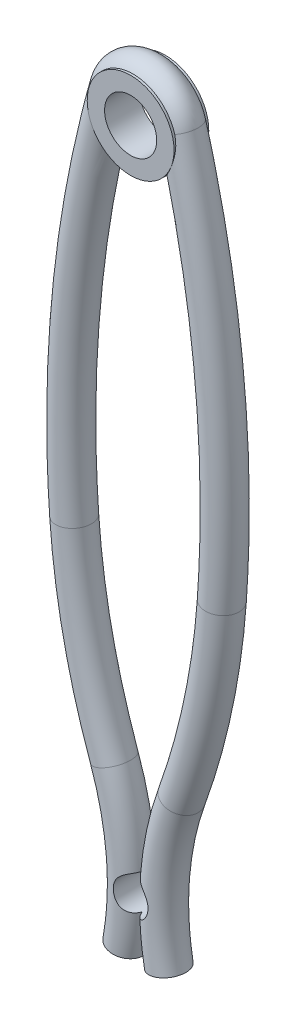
ISO-10303-21;
HEADER;
FILE_DESCRIPTION(('STEP AP214'),'2;1');
FILE_NAME('part.step','',(''),(''),'','','');
FILE_SCHEMA(('AUTOMOTIVE_DESIGN { 1 0 10303 214 1 1 1 1 }'));
ENDSEC;
DATA;
#1=APPLICATION_CONTEXT('core data for automotive mechanical design processes');
#2=APPLICATION_PROTOCOL_DEFINITION('international standard','automotive_design',2000,#1);
#3=PRODUCT_CONTEXT('',#1,'mechanical');
#4=PRODUCT('Part','Part','',(#3));
#5=PRODUCT_RELATED_PRODUCT_CATEGORY('part','',(#4));
#6=PRODUCT_DEFINITION_FORMATION('','',#4);
#7=PRODUCT_DEFINITION_CONTEXT('part definition',#1,'design');
#8=PRODUCT_DEFINITION('design','',#6,#7);
#9=PRODUCT_DEFINITION_SHAPE('','',#8);
#10=(LENGTH_UNIT() NAMED_UNIT(*) SI_UNIT(.MILLI.,.METRE.));
#11=(NAMED_UNIT(*) PLANE_ANGLE_UNIT() SI_UNIT($,.RADIAN.));
#12=(NAMED_UNIT(*) SI_UNIT($,.STERADIAN.) SOLID_ANGLE_UNIT());
#13=UNCERTAINTY_MEASURE_WITH_UNIT(LENGTH_MEASURE(1.E-05),#10,'distance_accuracy_value','');
#14=(GEOMETRIC_REPRESENTATION_CONTEXT(3) GLOBAL_UNCERTAINTY_ASSIGNED_CONTEXT((#13)) GLOBAL_UNIT_ASSIGNED_CONTEXT((#10,
#11,#12)) REPRESENTATION_CONTEXT('',''));
#15=CARTESIAN_POINT('',(0.,0.,0.));
#16=DIRECTION('',(0.,0.,1.));
#17=DIRECTION('',(1.,0.,0.));
#18=AXIS2_PLACEMENT_3D('',#15,#16,#17);
#19=CARTESIAN_POINT('',(-77.8012529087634,9.1082730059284,0.));
#20=DIRECTION('',(0.,0.,-1.));
#21=DIRECTION('',(-1.,0.,0.));
#22=AXIS2_PLACEMENT_3D('',#19,#20,#21);
#23=TOROIDAL_SURFACE('',#22,83.4112437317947,1.27);
#24=CARTESIAN_POINT('',(5.39740661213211,3.15691729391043,0.));
#25=DIRECTION('',(-0.0713495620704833,-0.997451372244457,0.));
#26=DIRECTION('',(0.,0.,-1.));
#27=AXIS2_PLACEMENT_3D('',#24,#25,#26);
#28=CIRCLE('',#27,1.27);
#29=CARTESIAN_POINT('',(6.66416985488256,3.06630335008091,0.));
#30=VERTEX_POINT('',#29);
#31=EDGE_CURVE('E190',#30,#30,#28,.T.);
#32=ORIENTED_EDGE('',*,*,#31,.F.);
#33=EDGE_LOOP('',(#32));
#34=FACE_BOUND('',#33,.T.);
#35=CARTESIAN_POINT('',(2.44357788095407,31.8723392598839,0.));
#36=DIRECTION('',(0.272913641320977,-0.962038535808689,0.));
#37=DIRECTION('',(0.,0.,-1.));
#38=AXIS2_PLACEMENT_3D('',#35,#36,#37);
#39=CIRCLE('',#38,1.27);
#40=CARTESIAN_POINT('',(3.05447235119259,32.0456394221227,-1.09985226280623));
#41=VERTEX_POINT('',#40);
#42=CARTESIAN_POINT('',(3.05447235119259,32.0456394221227,1.09985226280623));
#43=VERTEX_POINT('',#42);
#44=EDGE_CURVE('E124',#41,#43,#39,.T.);
#45=ORIENTED_EDGE('',*,*,#44,.T.);
#46=CARTESIAN_POINT('',(2.99983715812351,32.2191395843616,1.10273184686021));
#47=CARTESIAN_POINT('',(3.01281378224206,32.181709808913,1.10148162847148));
#48=CARTESIAN_POINT('',(3.0250920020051,32.1440291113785,1.10063601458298));
#49=CARTESIAN_POINT('',(3.04823172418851,32.068227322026,1.0997637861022));
#50=CARTESIAN_POINT('',(3.05909327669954,32.0301062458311,1.09973714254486));
#51=CARTESIAN_POINT('',(3.08950278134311,31.9152521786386,1.10089943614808));
#52=CARTESIAN_POINT('',(3.10690328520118,31.8379484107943,1.10332789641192));
#53=CARTESIAN_POINT('',(3.13580163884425,31.6827122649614,1.11119955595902));
#54=CARTESIAN_POINT('',(3.14732122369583,31.6047832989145,1.11663149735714));
#55=CARTESIAN_POINT('',(3.16453225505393,31.448480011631,1.12988694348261));
#56=CARTESIAN_POINT('',(3.17022266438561,31.3701056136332,1.13771087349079));
#57=CARTESIAN_POINT('',(3.17584267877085,31.2116828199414,1.15508836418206));
#58=CARTESIAN_POINT('',(3.17564950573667,31.1316336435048,1.16467463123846));
#59=CARTESIAN_POINT('',(3.16923739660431,30.9718687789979,1.18440533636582));
#60=CARTESIAN_POINT('',(3.1630178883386,30.8921531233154,1.19454982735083));
#61=CARTESIAN_POINT('',(3.13531874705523,30.6538390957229,1.22414900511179));
#62=CARTESIAN_POINT('',(3.10480006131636,30.4960290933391,1.24277547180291));
#63=CARTESIAN_POINT('',(3.03078538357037,30.2255572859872,1.2644004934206));
#64=CARTESIAN_POINT('',(2.99258995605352,30.1116528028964,1.2701744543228));
#65=CARTESIAN_POINT('',(2.90349262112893,29.888932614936,1.26981817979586));
#66=CARTESIAN_POINT('',(2.85261768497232,29.7801066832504,1.2637130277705));
#67=CARTESIAN_POINT('',(2.75444396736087,29.5975217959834,1.23777736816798));
#68=CARTESIAN_POINT('',(2.70956615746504,29.5219198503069,1.22186240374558));
#69=CARTESIAN_POINT('',(2.6154999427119,29.3771419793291,1.1779121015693));
#70=CARTESIAN_POINT('',(2.56631692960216,29.307958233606,1.14989175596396));
#71=CARTESIAN_POINT('',(2.47517065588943,29.1894776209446,1.08593909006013));
#72=CARTESIAN_POINT('',(2.43343675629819,29.1388135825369,1.05222560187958));
#73=CARTESIAN_POINT('',(2.35121514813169,29.044585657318,0.974765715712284));
#74=CARTESIAN_POINT('',(2.31072698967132,29.0010191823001,0.93102298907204));
#75=CARTESIAN_POINT('',(2.23340031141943,28.92178655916,0.833600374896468));
#76=CARTESIAN_POINT('',(2.19658104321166,28.8861609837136,0.779871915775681));
#77=CARTESIAN_POINT('',(2.12946835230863,28.8236975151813,0.663878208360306));
#78=CARTESIAN_POINT('',(2.0991739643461,28.7968583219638,0.601614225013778));
#79=CARTESIAN_POINT('',(2.04968301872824,28.7541853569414,0.476515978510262));
#80=CARTESIAN_POINT('',(2.02973035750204,28.7375755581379,0.41424300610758));
#81=CARTESIAN_POINT('',(1.99824253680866,28.711736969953,0.286141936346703));
#82=CARTESIAN_POINT('',(1.98670560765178,28.7025066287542,0.220314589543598));
#83=CARTESIAN_POINT('',(1.97292983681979,28.6915196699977,0.0891207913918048));
#84=CARTESIAN_POINT('',(1.97042008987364,28.6895452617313,0.0238007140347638));
#85=CARTESIAN_POINT('',(1.97407555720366,28.692442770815,-0.106441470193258));
#86=CARTESIAN_POINT('',(1.9802401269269,28.6973141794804,-0.171363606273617));
#87=CARTESIAN_POINT('',(2.00087462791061,28.713920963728,-0.298735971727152));
#88=CARTESIAN_POINT('',(2.01531588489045,28.7256326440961,-0.361193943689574));
#89=CARTESIAN_POINT('',(2.05168659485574,28.7559663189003,-0.482114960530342));
#90=CARTESIAN_POINT('',(2.07361543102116,28.7745877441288,-0.540578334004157));
#91=CARTESIAN_POINT('',(2.12384201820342,28.8188336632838,-0.652198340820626));
#92=CARTESIAN_POINT('',(2.15216817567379,28.844489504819,-0.705329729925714));
#93=CARTESIAN_POINT('',(2.21350977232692,28.9025670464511,-0.804719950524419));
#94=CARTESIAN_POINT('',(2.24652519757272,28.9349887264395,-0.850978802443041));
#95=CARTESIAN_POINT('',(2.3164847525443,29.0072447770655,-0.937154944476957));
#96=CARTESIAN_POINT('',(2.35351867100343,29.0472770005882,-0.976832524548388));
#97=CARTESIAN_POINT('',(2.42865428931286,29.1332829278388,-1.04782027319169));
#98=CARTESIAN_POINT('',(2.46675636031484,29.1792587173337,-1.07912749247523));
#99=CARTESIAN_POINT('',(2.5461207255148,29.2811215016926,-1.13646266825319));
#100=CARTESIAN_POINT('',(2.5873124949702,29.3375406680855,-1.16163542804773));
#101=CARTESIAN_POINT('',(2.66713790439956,29.4551719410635,-1.2032489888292));
#102=CARTESIAN_POINT('',(2.7057703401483,29.5163862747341,-1.2196857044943));
#103=CARTESIAN_POINT('',(2.77209683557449,29.6300890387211,-1.24265296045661));
#104=CARTESIAN_POINT('',(2.80045208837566,29.6819411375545,-1.25049254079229));
#105=CARTESIAN_POINT('',(2.85438995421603,29.7875194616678,-1.26210569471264));
#106=CARTESIAN_POINT('',(2.87997119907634,29.8412465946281,-1.26587727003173));
#107=CARTESIAN_POINT('',(2.95228390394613,30.004891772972,-1.27216009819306));
#108=CARTESIAN_POINT('',(2.99445887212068,30.1170591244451,-1.26960271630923));
#109=CARTESIAN_POINT('',(3.05576322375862,30.3129045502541,-1.25802025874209));
#110=CARTESIAN_POINT('',(3.07803915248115,30.3957843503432,-1.25100233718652));
#111=CARTESIAN_POINT('',(3.11579189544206,30.5628654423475,-1.23429962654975));
#112=CARTESIAN_POINT('',(3.13126560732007,30.647067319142,-1.22461362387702));
#113=CARTESIAN_POINT('',(3.15535378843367,30.8162704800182,-1.20411998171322));
#114=CARTESIAN_POINT('',(3.16397030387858,30.9012715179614,-1.19331267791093));
#115=CARTESIAN_POINT('',(3.17433037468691,31.0717207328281,-1.17199831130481));
#116=CARTESIAN_POINT('',(3.17607492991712,31.1571688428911,-1.16149120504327));
#117=CARTESIAN_POINT('',(3.17271429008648,31.3251420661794,-1.14242335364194));
#118=CARTESIAN_POINT('',(3.16784525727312,31.4076654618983,-1.13380761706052));
#119=CARTESIAN_POINT('',(3.1516495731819,31.5722910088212,-1.11909660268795));
#120=CARTESIAN_POINT('',(3.14032438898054,31.6543932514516,-1.11300075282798));
#121=CARTESIAN_POINT('',(3.11119301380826,31.8178993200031,-1.104073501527));
#122=CARTESIAN_POINT('',(3.09336719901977,31.8993002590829,-1.10125209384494));
#123=CARTESIAN_POINT('',(3.06185570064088,32.0202121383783,-1.0997608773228));
#124=CARTESIAN_POINT('',(3.05054773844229,32.0603428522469,-1.09972146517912));
#125=CARTESIAN_POINT('',(3.02636323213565,32.1401214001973,-1.10054914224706));
#126=CARTESIAN_POINT('',(3.01348661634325,32.1797692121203,-1.10141627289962));
#127=CARTESIAN_POINT('',(2.99983715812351,32.2191395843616,-1.10273184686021));
#128=B_SPLINE_CURVE_WITH_KNOTS('',3,(#46,#47,#48,#49,#50,#51,#52,#53,#54,#55,#56,#57,#58,#59,
#60,#61,#62,#63,#64,#65,#66,#67,#68,#69,#70,#71,#72,#73,#74,#75,#76,#77,#78,#79,#80,#81,#82,#83,
#84,#85,#86,#87,#88,#89,#90,#91,#92,#93,#94,#95,#96,#97,#98,#99,#100,#101,#102,#103,#104,#105,
#106,#107,#108,#109,#110,#111,#112,#113,#114,#115,#116,#117,#118,#119,#120,#121,#122,#123,#124,
#125,#126,#127),.UNSPECIFIED.,.F.,.F.,(4,2,2,2,2,2,2,2,2,2,2,2,2,2,2,2,2,2,2,2,2,2,2,2,2,2,2,2,
2,2,2,2,2,2,2,2,2,2,2,2,4),(0.,0.118887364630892,0.237770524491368,0.475283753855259,
0.711912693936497,0.948583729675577,1.19019691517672,1.43183304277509,1.91497152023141,
2.27479335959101,2.63385623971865,2.90096184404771,3.16773759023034,3.38818798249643,
3.60855780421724,3.83002899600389,4.05146740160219,4.25287081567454,4.45423186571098,
4.6494971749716,4.84474797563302,5.03932639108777,5.23388878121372,5.4293327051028,
5.6247760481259,5.8262498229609,6.02779449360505,6.24974076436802,6.4717907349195,
6.65039173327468,6.82908042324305,7.18720214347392,7.44524469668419,7.70340481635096,
7.96148787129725,8.21953337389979,8.46860258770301,8.71761522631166,8.96738588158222,
9.09242951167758,9.21747885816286),.UNSPECIFIED.);
#129=CARTESIAN_POINT('',(2.94995893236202,30.0050997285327,1.27));
#130=VERTEX_POINT('',#129);
#131=EDGE_CURVE('E50',#43,#130,#128,.T.);
#132=ORIENTED_EDGE('',*,*,#131,.T.);
#133=CARTESIAN_POINT('',(2.94995893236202,30.0050997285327,-1.27));
#134=VERTEX_POINT('',#133);
#135=EDGE_CURVE('E54',#130,#134,#128,.T.);
#136=ORIENTED_EDGE('',*,*,#135,.T.);
#137=EDGE_CURVE('E163',#134,#41,#128,.T.);
#138=ORIENTED_EDGE('',*,*,#137,.T.);
#139=EDGE_LOOP('',(#45,#132,#136,#138));
#140=FACE_BOUND('',#139,.T.);
#141=ADVANCED_FACE('F32',(#34,#140),#23,.T.);
#142=CARTESIAN_POINT('',(0.,31.1791386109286,0.));
#143=DIRECTION('',(0.,0.,1.));
#144=DIRECTION('',(1.,0.,0.));
#145=AXIS2_PLACEMENT_3D('',#142,#143,#144);
#146=TOROIDAL_SURFACE('',#145,2.54,1.27);
#147=CARTESIAN_POINT('',(0.,31.1791386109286,1.09985226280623));
#148=DIRECTION('',(0.,0.,-1.));
#149=DIRECTION('',(-1.,0.,0.));
#150=AXIS2_PLACEMENT_3D('',#147,#148,#149);
#151=CIRCLE('',#150,3.175);
#152=CARTESIAN_POINT('',(-3.05447235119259,32.0456394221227,1.09985226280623));
#153=VERTEX_POINT('',#152);
#154=EDGE_CURVE('E126',#43,#153,#151,.F.);
#155=ORIENTED_EDGE('',*,*,#154,.F.);
#156=ORIENTED_EDGE('',*,*,#44,.F.);
#157=CARTESIAN_POINT('',(0.,31.1791386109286,-1.09985226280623));
#158=DIRECTION('',(0.,0.,1.));
#159=DIRECTION('',(1.,0.,0.));
#160=AXIS2_PLACEMENT_3D('',#157,#158,#159);
#161=CIRCLE('',#160,3.175);
#162=CARTESIAN_POINT('',(-3.05447235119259,32.0456394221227,-1.09985226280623));
#163=VERTEX_POINT('',#162);
#164=EDGE_CURVE('E122',#163,#41,#161,.F.);
#165=ORIENTED_EDGE('',*,*,#164,.F.);
#166=CARTESIAN_POINT('',(-2.44357788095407,31.8723392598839,0.));
#167=DIRECTION('',(0.272913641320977,0.962038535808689,0.));
#168=DIRECTION('',(0.,0.,-1.));
#169=AXIS2_PLACEMENT_3D('',#166,#167,#168);
#170=CIRCLE('',#169,1.27);
#171=EDGE_CURVE('E110',#163,#153,#170,.T.);
#172=ORIENTED_EDGE('',*,*,#171,.T.);
#173=EDGE_LOOP('',(#155,#156,#165,#172));
#174=FACE_BOUND('',#173,.T.);
#175=ADVANCED_FACE('F123',(#174),#146,.T.);
#176=CARTESIAN_POINT('',(77.8012529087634,9.1082730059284,0.));
#177=DIRECTION('',(0.,0.,1.));
#178=DIRECTION('',(1.,0.,0.));
#179=AXIS2_PLACEMENT_3D('',#176,#177,#178);
#180=TOROIDAL_SURFACE('',#179,83.4112437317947,1.27);
#181=CARTESIAN_POINT('',(-5.39740661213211,3.15691729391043,0.));
#182=DIRECTION('',(-0.0713495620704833,0.997451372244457,0.));
#183=DIRECTION('',(0.,0.,-1.));
#184=AXIS2_PLACEMENT_3D('',#181,#182,#183);
#185=CIRCLE('',#184,1.27);
#186=CARTESIAN_POINT('',(-6.66416985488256,3.06630335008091,0.));
#187=VERTEX_POINT('',#186);
#188=EDGE_CURVE('E117',#187,#187,#185,.T.);
#189=ORIENTED_EDGE('',*,*,#188,.T.);
#190=EDGE_LOOP('',(#189));
#191=FACE_BOUND('',#190,.T.);
#192=CARTESIAN_POINT('',(-2.99983715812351,32.2191395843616,1.10273184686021));
#193=CARTESIAN_POINT('',(-3.01281378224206,32.181709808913,1.10148162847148));
#194=CARTESIAN_POINT('',(-3.0250920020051,32.1440291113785,1.10063601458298));
#195=CARTESIAN_POINT('',(-3.04823172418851,32.068227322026,1.0997637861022));
#196=CARTESIAN_POINT('',(-3.05909327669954,32.0301062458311,1.09973714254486));
#197=CARTESIAN_POINT('',(-3.08950278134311,31.9152521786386,1.10089943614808));
#198=CARTESIAN_POINT('',(-3.10690328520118,31.8379484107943,1.10332789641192));
#199=CARTESIAN_POINT('',(-3.13580163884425,31.6827122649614,1.11119955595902));
#200=CARTESIAN_POINT('',(-3.14732122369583,31.6047832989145,1.11663149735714));
#201=CARTESIAN_POINT('',(-3.16453225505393,31.448480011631,1.12988694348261));
#202=CARTESIAN_POINT('',(-3.17022266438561,31.3701056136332,1.13771087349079));
#203=CARTESIAN_POINT('',(-3.17584267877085,31.2116828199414,1.15508836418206));
#204=CARTESIAN_POINT('',(-3.17564950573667,31.1316336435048,1.16467463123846));
#205=CARTESIAN_POINT('',(-3.16923739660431,30.9718687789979,1.18440533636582));
#206=CARTESIAN_POINT('',(-3.1630178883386,30.8921531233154,1.19454982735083));
#207=CARTESIAN_POINT('',(-3.13531874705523,30.6538390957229,1.22414900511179));
#208=CARTESIAN_POINT('',(-3.10480006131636,30.4960290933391,1.24277547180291));
#209=CARTESIAN_POINT('',(-3.03078538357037,30.2255572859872,1.2644004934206));
#210=CARTESIAN_POINT('',(-2.99258995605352,30.1116528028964,1.2701744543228));
#211=CARTESIAN_POINT('',(-2.90349262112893,29.888932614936,1.26981817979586));
#212=CARTESIAN_POINT('',(-2.85261768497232,29.7801066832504,1.2637130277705));
#213=CARTESIAN_POINT('',(-2.75444396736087,29.5975217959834,1.23777736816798));
#214=CARTESIAN_POINT('',(-2.70956615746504,29.5219198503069,1.22186240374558));
#215=CARTESIAN_POINT('',(-2.6154999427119,29.3771419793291,1.1779121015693));
#216=CARTESIAN_POINT('',(-2.56631692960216,29.307958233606,1.14989175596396));
#217=CARTESIAN_POINT('',(-2.47517065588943,29.1894776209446,1.08593909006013));
#218=CARTESIAN_POINT('',(-2.43343675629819,29.1388135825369,1.05222560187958));
#219=CARTESIAN_POINT('',(-2.35121514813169,29.044585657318,0.974765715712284));
#220=CARTESIAN_POINT('',(-2.31072698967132,29.0010191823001,0.93102298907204));
#221=CARTESIAN_POINT('',(-2.23340031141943,28.92178655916,0.833600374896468));
#222=CARTESIAN_POINT('',(-2.19658104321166,28.8861609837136,0.779871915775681));
#223=CARTESIAN_POINT('',(-2.12946835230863,28.8236975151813,0.663878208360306));
#224=CARTESIAN_POINT('',(-2.0991739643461,28.7968583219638,0.601614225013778));
#225=CARTESIAN_POINT('',(-2.04968301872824,28.7541853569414,0.476515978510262));
#226=CARTESIAN_POINT('',(-2.02973035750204,28.7375755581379,0.41424300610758));
#227=CARTESIAN_POINT('',(-1.99824253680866,28.711736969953,0.286141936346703));
#228=CARTESIAN_POINT('',(-1.98670560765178,28.7025066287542,0.220314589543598));
#229=CARTESIAN_POINT('',(-1.97292983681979,28.6915196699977,0.0891207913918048));
#230=CARTESIAN_POINT('',(-1.97042008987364,28.6895452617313,0.0238007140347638));
#231=CARTESIAN_POINT('',(-1.97407555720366,28.692442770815,-0.106441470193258));
#232=CARTESIAN_POINT('',(-1.9802401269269,28.6973141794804,-0.171363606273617));
#233=CARTESIAN_POINT('',(-2.00087462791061,28.713920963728,-0.298735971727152));
#234=CARTESIAN_POINT('',(-2.01531588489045,28.7256326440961,-0.361193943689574));
#235=CARTESIAN_POINT('',(-2.05168659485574,28.7559663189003,-0.482114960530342));
#236=CARTESIAN_POINT('',(-2.07361543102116,28.7745877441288,-0.540578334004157));
#237=CARTESIAN_POINT('',(-2.12384201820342,28.8188336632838,-0.652198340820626));
#238=CARTESIAN_POINT('',(-2.15216817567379,28.844489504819,-0.705329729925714));
#239=CARTESIAN_POINT('',(-2.21350977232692,28.9025670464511,-0.804719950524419));
#240=CARTESIAN_POINT('',(-2.24652519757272,28.9349887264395,-0.850978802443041));
#241=CARTESIAN_POINT('',(-2.3164847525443,29.0072447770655,-0.937154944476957));
#242=CARTESIAN_POINT('',(-2.35351867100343,29.0472770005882,-0.976832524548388));
#243=CARTESIAN_POINT('',(-2.42865428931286,29.1332829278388,-1.04782027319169));
#244=CARTESIAN_POINT('',(-2.46675636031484,29.1792587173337,-1.07912749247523));
#245=CARTESIAN_POINT('',(-2.5461207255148,29.2811215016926,-1.13646266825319));
#246=CARTESIAN_POINT('',(-2.5873124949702,29.3375406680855,-1.16163542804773));
#247=CARTESIAN_POINT('',(-2.66713790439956,29.4551719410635,-1.2032489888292));
#248=CARTESIAN_POINT('',(-2.7057703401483,29.5163862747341,-1.2196857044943));
#249=CARTESIAN_POINT('',(-2.77209683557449,29.6300890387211,-1.24265296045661));
#250=CARTESIAN_POINT('',(-2.80045208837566,29.6819411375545,-1.25049254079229));
#251=CARTESIAN_POINT('',(-2.85438995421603,29.7875194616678,-1.26210569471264));
#252=CARTESIAN_POINT('',(-2.87997119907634,29.8412465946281,-1.26587727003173));
#253=CARTESIAN_POINT('',(-2.95228390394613,30.004891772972,-1.27216009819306));
#254=CARTESIAN_POINT('',(-2.99445887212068,30.1170591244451,-1.26960271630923));
#255=CARTESIAN_POINT('',(-3.05576322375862,30.3129045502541,-1.25802025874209));
#256=CARTESIAN_POINT('',(-3.07803915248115,30.3957843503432,-1.25100233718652));
#257=CARTESIAN_POINT('',(-3.11579189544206,30.5628654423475,-1.23429962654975));
#258=CARTESIAN_POINT('',(-3.13126560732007,30.647067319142,-1.22461362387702));
#259=CARTESIAN_POINT('',(-3.15535378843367,30.8162704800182,-1.20411998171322));
#260=CARTESIAN_POINT('',(-3.16397030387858,30.9012715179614,-1.19331267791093));
#261=CARTESIAN_POINT('',(-3.17433037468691,31.0717207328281,-1.17199831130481));
#262=CARTESIAN_POINT('',(-3.17607492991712,31.1571688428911,-1.16149120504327));
#263=CARTESIAN_POINT('',(-3.17271429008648,31.3251420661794,-1.14242335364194));
#264=CARTESIAN_POINT('',(-3.16784525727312,31.4076654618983,-1.13380761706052));
#265=CARTESIAN_POINT('',(-3.1516495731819,31.5722910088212,-1.11909660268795));
#266=CARTESIAN_POINT('',(-3.14032438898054,31.6543932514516,-1.11300075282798));
#267=CARTESIAN_POINT('',(-3.11119301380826,31.8178993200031,-1.104073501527));
#268=CARTESIAN_POINT('',(-3.09336719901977,31.8993002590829,-1.10125209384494));
#269=CARTESIAN_POINT('',(-3.06185570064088,32.0202121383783,-1.0997608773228));
#270=CARTESIAN_POINT('',(-3.05054773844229,32.0603428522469,-1.09972146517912));
#271=CARTESIAN_POINT('',(-3.02636323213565,32.1401214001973,-1.10054914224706));
#272=CARTESIAN_POINT('',(-3.01348661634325,32.1797692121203,-1.10141627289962));
#273=CARTESIAN_POINT('',(-2.99983715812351,32.2191395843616,-1.10273184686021));
#274=B_SPLINE_CURVE_WITH_KNOTS('',3,(#192,#193,#194,#195,#196,#197,#198,#199,#200,#201,#202,
#203,#204,#205,#206,#207,#208,#209,#210,#211,#212,#213,#214,#215,#216,#217,#218,#219,#220,#221,
#222,#223,#224,#225,#226,#227,#228,#229,#230,#231,#232,#233,#234,#235,#236,#237,#238,#239,#240,
#241,#242,#243,#244,#245,#246,#247,#248,#249,#250,#251,#252,#253,#254,#255,#256,#257,#258,#259,
#260,#261,#262,#263,#264,#265,#266,#267,#268,#269,#270,#271,#272,#273),.UNSPECIFIED.,.F.,.F.,(4,
2,2,2,2,2,2,2,2,2,2,2,2,2,2,2,2,2,2,2,2,2,2,2,2,2,2,2,2,2,2,2,2,2,2,2,2,2,2,2,4),(0.,
0.118887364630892,0.237770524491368,0.475283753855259,0.711912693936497,0.948583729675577,
1.19019691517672,1.43183304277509,1.91497152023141,2.27479335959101,2.63385623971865,
2.90096184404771,3.16773759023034,3.38818798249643,3.60855780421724,3.83002899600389,
4.05146740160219,4.25287081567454,4.45423186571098,4.6494971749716,4.84474797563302,
5.03932639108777,5.23388878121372,5.4293327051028,5.6247760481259,5.8262498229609,
6.02779449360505,6.24974076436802,6.4717907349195,6.65039173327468,6.82908042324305,
7.18720214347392,7.44524469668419,7.70340481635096,7.96148787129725,8.21953337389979,
8.46860258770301,8.71761522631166,8.96738588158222,9.09242951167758,9.21747885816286),.UNSPECIFIED.);
#275=CARTESIAN_POINT('',(-2.94995893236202,30.0050997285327,1.27));
#276=VERTEX_POINT('',#275);
#277=EDGE_CURVE('E11',#153,#276,#274,.T.);
#278=ORIENTED_EDGE('',*,*,#277,.F.);
#279=ORIENTED_EDGE('',*,*,#171,.F.);
#280=CARTESIAN_POINT('',(-2.94995893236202,30.0050997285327,-1.27));
#281=VERTEX_POINT('',#280);
#282=EDGE_CURVE('E43',#281,#163,#274,.T.);
#283=ORIENTED_EDGE('',*,*,#282,.F.);
#284=EDGE_CURVE('E42',#276,#281,#274,.T.);
#285=ORIENTED_EDGE('',*,*,#284,.F.);
#286=EDGE_LOOP('',(#278,#279,#283,#285));
#287=FACE_BOUND('',#286,.T.);
#288=ADVANCED_FACE('F112',(#191,#287),#180,.T.);
#289=CARTESIAN_POINT('',(22.9736222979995,-18.0876697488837,0.));
#290=DIRECTION('',(0.,0.,1.));
#291=DIRECTION('',(1.,0.,0.));
#292=AXIS2_PLACEMENT_3D('',#289,#290,#291);
#293=TOROIDAL_SURFACE('',#292,21.791549,1.27);
#294=CARTESIAN_POINT('',(1.18262633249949,-18.2429200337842,1.27));
#295=CARTESIAN_POINT('',(1.18725294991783,-18.2311005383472,1.26999999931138));
#296=CARTESIAN_POINT('',(1.19170226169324,-18.2192116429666,1.26999327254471));
#297=CARTESIAN_POINT('',(1.2002425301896,-18.195305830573,1.26996636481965));
#298=CARTESIAN_POINT('',(1.20433348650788,-18.183288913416,1.26994618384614));
#299=CARTESIAN_POINT('',(1.21215329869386,-18.1591378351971,1.2698923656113));
#300=CARTESIAN_POINT('',(1.2158821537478,-18.1470036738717,1.26985872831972));
#301=CARTESIAN_POINT('',(1.22297443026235,-18.1226290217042,1.26977800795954));
#302=CARTESIAN_POINT('',(1.22633785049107,-18.1103885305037,1.26973092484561));
#303=CARTESIAN_POINT('',(1.23269622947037,-18.0858122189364,1.26962327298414));
#304=CARTESIAN_POINT('',(1.2356911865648,-18.0734763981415,1.26956270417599));
#305=CARTESIAN_POINT('',(1.24130994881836,-18.0487205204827,1.26942822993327));
#306=CARTESIAN_POINT('',(1.2439337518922,-18.036300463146,1.26935432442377));
#307=CARTESIAN_POINT('',(1.248807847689,-18.0113872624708,1.26919262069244));
#308=CARTESIAN_POINT('',(1.25105813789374,-17.9988941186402,1.26910482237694));
#309=CARTESIAN_POINT('',(1.25518318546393,-17.9738460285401,1.26891740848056));
#310=CARTESIAN_POINT('',(1.25705793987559,-17.9612910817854,1.26881779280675));
#311=CARTESIAN_POINT('',(1.26043023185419,-17.9361304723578,1.26859899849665));
#312=CARTESIAN_POINT('',(1.26192776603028,-17.9235248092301,1.26847981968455));
#313=CARTESIAN_POINT('',(1.26454426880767,-17.8982748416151,1.26825080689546));
#314=CARTESIAN_POINT('',(1.26566323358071,-17.8856305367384,1.26814097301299));
#315=CARTESIAN_POINT('',(1.26845059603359,-17.8476551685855,1.26766369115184));
#316=CARTESIAN_POINT('',(1.26954978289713,-17.8222792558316,1.26714847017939));
#317=CARTESIAN_POINT('',(1.26996254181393,-17.7912652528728,1.26708178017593));
#318=CARTESIAN_POINT('',(1.27000000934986,-17.7856327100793,1.2670923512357));
#319=CARTESIAN_POINT('',(1.26999996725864,-17.7602753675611,1.26713602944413));
#320=CARTESIAN_POINT('',(1.26954036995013,-17.740548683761,1.26715935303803));
#321=CARTESIAN_POINT('',(1.26743945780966,-17.6954946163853,1.26726068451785));
#322=CARTESIAN_POINT('',(1.26549743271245,-17.67018105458,1.26735243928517));
#323=CARTESIAN_POINT('',(1.26010040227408,-17.6197160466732,1.26758003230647));
#324=CARTESIAN_POINT('',(1.25664538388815,-17.5945646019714,1.26771587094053));
#325=CARTESIAN_POINT('',(1.24823484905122,-17.5445137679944,1.26803842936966));
#326=CARTESIAN_POINT('',(1.24327931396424,-17.5196143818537,1.26822514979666));
#327=CARTESIAN_POINT('',(1.23188525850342,-17.4701572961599,1.26864768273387));
#328=CARTESIAN_POINT('',(1.22544671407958,-17.4455996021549,1.26888349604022));
#329=CARTESIAN_POINT('',(1.21111088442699,-17.3969137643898,1.26940457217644));
#330=CARTESIAN_POINT('',(1.20321357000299,-17.3727856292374,1.269689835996));
#331=CARTESIAN_POINT('',(1.19459910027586,-17.3489164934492,1.27));
#332=B_SPLINE_CURVE_WITH_KNOTS('',3,(#294,#295,#296,#297,#298,#299,#300,#301,#302,#303,#304,
#305,#306,#307,#308,#309,#310,#311,#312,#313,#314,#315,#316,#317,#318,#319,#320,#321,#322,#323,
#324,#325,#326,#327,#328,#329,#330,#331),.UNSPECIFIED.,.F.,.F.,(4,2,2,2,2,2,2,2,2,2,2,2,2,2,2,2,
2,2,4),(0.,0.0380768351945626,0.0761537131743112,0.114230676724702,0.1523077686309,
0.190385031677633,0.228462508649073,0.266540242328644,0.304618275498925,0.342696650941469,
0.380775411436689,0.45692569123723,0.473823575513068,0.532996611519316,0.60911453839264,
0.685233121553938,0.761352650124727,0.837473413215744,0.913595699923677),.UNSPECIFIED.);
#333=CARTESIAN_POINT('',(1.18262633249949,-18.2429200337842,1.27));
#334=VERTEX_POINT('',#333);
#335=CARTESIAN_POINT('',(1.19459910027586,-17.3489164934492,1.27));
#336=VERTEX_POINT('',#335);
#337=EDGE_CURVE('E271',#334,#336,#332,.T.);
#338=ORIENTED_EDGE('',*,*,#337,.F.);
#339=CARTESIAN_POINT('',(0.340545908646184,-19.0034902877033,-0.934460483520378));
#340=CARTESIAN_POINT('',(0.292350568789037,-19.0169022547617,-0.889629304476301));
#341=CARTESIAN_POINT('',(0.246969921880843,-19.0264544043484,-0.840438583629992));
#342=CARTESIAN_POINT('',(0.164060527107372,-19.0400679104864,-0.735016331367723));
#343=CARTESIAN_POINT('',(0.126562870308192,-19.0441078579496,-0.678758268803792));
#344=CARTESIAN_POINT('',(0.0610222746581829,-19.0489558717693,-0.561288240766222));
#345=CARTESIAN_POINT('',(0.0329265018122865,-19.0497822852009,-0.500106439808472));
#346=CARTESIAN_POINT('',(-0.0132725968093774,-19.0501416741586,-0.374153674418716));
#347=CARTESIAN_POINT('',(-0.0313847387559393,-19.0496757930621,-0.309385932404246));
#348=CARTESIAN_POINT('',(-0.0579135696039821,-19.0487542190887,-0.173939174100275));
#349=CARTESIAN_POINT('',(-0.0657017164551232,-19.0483007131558,-0.103135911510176));
#350=CARTESIAN_POINT('',(-0.0693112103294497,-19.0481084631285,0.038787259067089));
#351=CARTESIAN_POINT('',(-0.0651300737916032,-19.0483698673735,0.109907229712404));
#352=CARTESIAN_POINT('',(-0.0449107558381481,-19.0492453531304,0.250610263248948));
#353=CARTESIAN_POINT('',(-0.028844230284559,-19.0498602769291,0.320189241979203));
#354=CARTESIAN_POINT('',(0.0146855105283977,-19.0501002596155,0.455730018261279));
#355=CARTESIAN_POINT('',(0.0421543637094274,-19.0497248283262,0.52169000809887));
#356=CARTESIAN_POINT('',(0.107741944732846,-19.0458483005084,0.648300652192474));
#357=CARTESIAN_POINT('',(0.145896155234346,-19.0423367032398,0.708932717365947));
#358=CARTESIAN_POINT('',(0.231395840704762,-19.029485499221,0.82263723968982));
#359=CARTESIAN_POINT('',(0.278732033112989,-19.0201517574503,0.875717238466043));
#360=CARTESIAN_POINT('',(0.376212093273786,-18.9939604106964,0.968551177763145));
#361=CARTESIAN_POINT('',(0.425838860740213,-18.9777553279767,1.00902654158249));
#362=CARTESIAN_POINT('',(0.527969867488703,-18.936357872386,1.08063536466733));
#363=CARTESIAN_POINT('',(0.580470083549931,-18.9111778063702,1.11178150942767));
#364=CARTESIAN_POINT('',(0.677249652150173,-18.8555876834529,1.16066268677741));
#365=CARTESIAN_POINT('',(0.721623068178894,-18.8264548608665,1.179683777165));
#366=CARTESIAN_POINT('',(0.80771331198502,-18.7615318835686,1.21127656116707));
#367=CARTESIAN_POINT('',(0.849429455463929,-18.7257400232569,1.22384659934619));
#368=CARTESIAN_POINT('',(0.928145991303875,-18.6485988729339,1.24357752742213));
#369=CARTESIAN_POINT('',(0.965177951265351,-18.6072911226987,1.25077642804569));
#370=CARTESIAN_POINT('',(1.0337105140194,-18.5198862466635,1.26130465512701));
#371=CARTESIAN_POINT('',(1.06520876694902,-18.4737870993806,1.26463234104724));
#372=CARTESIAN_POINT('',(1.12574298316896,-18.3712758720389,1.26910379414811));
#373=CARTESIAN_POINT('',(1.15387098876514,-18.3143119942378,1.26989166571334));
#374=CARTESIAN_POINT('',(1.20132460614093,-18.1968208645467,1.2700876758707));
#375=CARTESIAN_POINT('',(1.22064591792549,-18.1362918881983,1.26949514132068));
#376=CARTESIAN_POINT('',(1.25167648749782,-18.00617719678,1.2682016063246));
#377=CARTESIAN_POINT('',(1.26230562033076,-17.9363309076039,1.26749586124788));
#378=CARTESIAN_POINT('',(1.27185234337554,-17.7958417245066,1.26695873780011));
#379=CARTESIAN_POINT('',(1.27076919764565,-17.7251987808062,1.26712741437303));
#380=CARTESIAN_POINT('',(1.2568372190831,-17.5841888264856,1.26814950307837));
#381=CARTESIAN_POINT('',(1.24384071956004,-17.5138364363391,1.26901149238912));
#382=CARTESIAN_POINT('',(1.20622584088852,-17.3762577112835,1.27010637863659));
#383=CARTESIAN_POINT('',(1.18160085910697,-17.3090331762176,1.27033891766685));
#384=CARTESIAN_POINT('',(1.12140132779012,-17.1796214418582,1.26793131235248));
#385=CARTESIAN_POINT('',(1.08581653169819,-17.1174390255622,1.26528847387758));
#386=CARTESIAN_POINT('',(1.00498039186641,-17.0002821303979,1.25427074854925));
#387=CARTESIAN_POINT('',(0.959740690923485,-16.9452990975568,1.24590273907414));
#388=CARTESIAN_POINT('',(0.866060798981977,-16.8488910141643,1.22159675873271));
#389=CARTESIAN_POINT('',(0.818221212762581,-16.806710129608,1.20636410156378));
#390=CARTESIAN_POINT('',(0.71921473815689,-16.7314365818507,1.16696188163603));
#391=CARTESIAN_POINT('',(0.668051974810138,-16.6983329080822,1.14280323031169));
#392=CARTESIAN_POINT('',(0.57323970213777,-16.6456209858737,1.0891679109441));
#393=CARTESIAN_POINT('',(0.529564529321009,-16.6247584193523,1.06095003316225));
#394=CARTESIAN_POINT('',(0.444454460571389,-16.5894182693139,0.997913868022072));
#395=CARTESIAN_POINT('',(0.403020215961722,-16.574942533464,0.963093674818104));
#396=CARTESIAN_POINT('',(0.323958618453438,-16.5513151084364,0.887455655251));
#397=CARTESIAN_POINT('',(0.286350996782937,-16.5421899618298,0.846609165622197));
#398=CARTESIAN_POINT('',(0.216414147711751,-16.5280656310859,0.759995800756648));
#399=CARTESIAN_POINT('',(0.184087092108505,-16.5230681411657,0.714226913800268));
#400=CARTESIAN_POINT('',(0.121572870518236,-16.5153868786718,0.612205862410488));
#401=CARTESIAN_POINT('',(0.0922788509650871,-16.5131116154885,0.555375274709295));
#402=CARTESIAN_POINT('',(0.0424418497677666,-16.5104636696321,0.437949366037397));
#403=CARTESIAN_POINT('',(0.0219032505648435,-16.5100919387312,0.377352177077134));
#404=CARTESIAN_POINT('',(-0.011534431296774,-16.5099284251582,0.247241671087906));
#405=CARTESIAN_POINT('',(-0.0234034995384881,-16.510201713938,0.177460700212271));
#406=CARTESIAN_POINT('',(-0.0353566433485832,-16.5104780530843,0.0369011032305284));
#407=CARTESIAN_POINT('',(-0.035440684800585,-16.5104811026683,-0.0338775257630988));
#408=CARTESIAN_POINT('',(-0.0237684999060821,-16.5102090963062,-0.175137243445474));
#409=CARTESIAN_POINT('',(-0.0118985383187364,-16.5099313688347,-0.24560894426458));
#410=CARTESIAN_POINT('',(0.0234564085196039,-16.5100949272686,-0.383608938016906));
#411=CARTESIAN_POINT('',(0.0469469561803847,-16.5105365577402,-0.451135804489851));
#412=CARTESIAN_POINT('',(0.104871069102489,-16.5140046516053,-0.581559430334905));
#413=CARTESIAN_POINT('',(0.139343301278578,-16.5170403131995,-0.644438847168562));
#414=CARTESIAN_POINT('',(0.217957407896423,-16.5282159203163,-0.763353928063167));
#415=CARTESIAN_POINT('',(0.262093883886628,-16.536353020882,-0.819393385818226));
#416=CARTESIAN_POINT('',(0.355304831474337,-16.5598232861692,-0.919757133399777));
#417=CARTESIAN_POINT('',(0.403965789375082,-16.574729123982,-0.96456094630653));
#418=CARTESIAN_POINT('',(0.50527027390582,-16.6135858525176,-1.04470126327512));
#419=CARTESIAN_POINT('',(0.557906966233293,-16.6375214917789,-1.0800535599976));
#420=CARTESIAN_POINT('',(0.655663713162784,-16.69112833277,-1.13612514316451));
#421=CARTESIAN_POINT('',(0.700745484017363,-16.7194298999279,-1.15823461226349));
#422=CARTESIAN_POINT('',(0.788738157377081,-16.7831351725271,-1.19542262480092));
#423=CARTESIAN_POINT('',(0.831648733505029,-16.8185399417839,-1.21050011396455));
#424=CARTESIAN_POINT('',(0.91158154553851,-16.8940962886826,-1.23413511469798));
#425=CARTESIAN_POINT('',(0.948771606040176,-16.933998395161,-1.24293136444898));
#426=CARTESIAN_POINT('',(1.0179829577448,-17.0186819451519,-1.25625244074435));
#427=CARTESIAN_POINT('',(1.05000237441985,-17.0634651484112,-1.26077572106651));
#428=CARTESIAN_POINT('',(1.11152308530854,-17.1625740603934,-1.26728757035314));
#429=CARTESIAN_POINT('',(1.14025721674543,-17.217399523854,-1.26890545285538));
#430=CARTESIAN_POINT('',(1.18946251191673,-17.3306686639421,-1.27026856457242));
#431=CARTESIAN_POINT('',(1.20992896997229,-17.389114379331,-1.2700127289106));
#432=CARTESIAN_POINT('',(1.24419329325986,-17.5159472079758,-1.26898404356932));
#433=CARTESIAN_POINT('',(1.2568154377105,-17.5846547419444,-1.26814970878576));
#434=CARTESIAN_POINT('',(1.27063929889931,-17.7232092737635,-1.2671383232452));
#435=CARTESIAN_POINT('',(1.27184053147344,-17.7930563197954,-1.26696130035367));
#436=CARTESIAN_POINT('',(1.26267947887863,-17.9337104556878,-1.26747300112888));
#437=CARTESIAN_POINT('',(1.2520331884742,-18.0044991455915,-1.26818304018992));
#438=CARTESIAN_POINT('',(1.21901138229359,-18.1433262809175,-1.26956688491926));
#439=CARTESIAN_POINT('',(1.19662922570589,-18.2113631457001,-1.27024066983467));
#440=CARTESIAN_POINT('',(1.14070774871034,-18.3428480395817,-1.26959993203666));
#441=CARTESIAN_POINT('',(1.10714789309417,-18.4062873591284,-1.26828173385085));
#442=CARTESIAN_POINT('',(1.02996625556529,-18.5264264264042,-1.26095551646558));
#443=CARTESIAN_POINT('',(0.986353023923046,-18.5831318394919,-1.25495147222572));
#444=CARTESIAN_POINT('',(0.893920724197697,-18.6845536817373,-1.23587052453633));
#445=CARTESIAN_POINT('',(0.845585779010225,-18.7297924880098,-1.22325057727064));
#446=CARTESIAN_POINT('',(0.744443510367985,-18.8109666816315,-1.18908685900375));
#447=CARTESIAN_POINT('',(0.691640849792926,-18.8469116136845,-1.16755230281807));
#448=CARTESIAN_POINT('',(0.593179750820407,-18.9041872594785,-1.11848672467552));
#449=CARTESIAN_POINT('',(0.54762872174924,-18.9268973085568,-1.09232672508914));
#450=CARTESIAN_POINT('',(0.458340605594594,-18.9654032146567,-1.03295478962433));
#451=CARTESIAN_POINT('',(0.414600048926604,-18.9812129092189,-0.999757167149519));
#452=CARTESIAN_POINT('',(0.361911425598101,-18.9973953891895,-0.953996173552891));
#453=CARTESIAN_POINT('',(0.351160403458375,-19.0005364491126,-0.944334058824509));
#454=CARTESIAN_POINT('',(0.340545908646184,-19.0034902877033,-0.934460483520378));
#455=B_SPLINE_CURVE_WITH_KNOTS('',3,(#339,#340,#341,#342,#343,#344,#345,#346,#347,#348,#349,
#350,#351,#352,#353,#354,#355,#356,#357,#358,#359,#360,#361,#362,#363,#364,#365,#366,#367,#368,
#369,#370,#371,#372,#373,#374,#375,#376,#377,#378,#379,#380,#381,#382,#383,#384,#385,#386,#387,
#388,#389,#390,#391,#392,#393,#394,#395,#396,#397,#398,#399,#400,#401,#402,#403,#404,#405,#406,
#407,#408,#409,#410,#411,#412,#413,#414,#415,#416,#417,#418,#419,#420,#421,#422,#423,#424,#425,
#426,#427,#428,#429,#430,#431,#432,#433,#434,#435,#436,#437,#438,#439,#440,#441,#442,#443,#444,
#445,#446,#447,#448,#449,#450,#451,#452,#453,#454),.UNSPECIFIED.,.T.,.F.,(4,2,2,2,2,2,2,2,2,2,2,
2,2,2,2,2,2,2,2,2,2,2,2,2,2,2,2,2,2,2,2,2,2,2,2,2,2,2,2,2,2,2,2,2,2,2,2,2,2,2,2,2,2,2,2,2,2,4),
(0.,0.201489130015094,0.403758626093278,0.604871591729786,0.805806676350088,1.01848581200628,
1.23120908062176,1.44444129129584,1.65777906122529,1.87183383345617,2.08567332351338,
2.28262222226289,2.47930208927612,2.64762883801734,2.81599876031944,2.98316554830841,
3.15040315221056,3.34024059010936,3.53017061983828,3.74113704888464,3.95211673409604,
4.16574741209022,4.37949953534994,4.59345210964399,4.80714812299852,5.00264651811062,
5.19790671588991,5.36517618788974,5.53249401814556,5.70063498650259,5.86884493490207,
6.05999598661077,6.25124260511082,6.46259294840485,6.67394390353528,6.88732491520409,
7.10080816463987,7.3150515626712,7.52917558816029,7.73133959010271,7.93316365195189,
8.10517311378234,8.27720835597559,8.44229532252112,8.60744200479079,8.79246947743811,
8.97760211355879,9.18622640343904,9.39485953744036,9.60860378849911,9.82246911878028,
10.0367295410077,10.2508084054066,10.4517415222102,10.6524674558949,10.8232939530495,
10.9937762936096,11.0381520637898),.UNSPECIFIED.);
#456=CARTESIAN_POINT('',(0.,-19.05,0.409350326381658));
#457=VERTEX_POINT('',#456);
#458=EDGE_CURVE('E269',#457,#334,#455,.T.);
#459=ORIENTED_EDGE('',*,*,#458,.F.);
#460=CARTESIAN_POINT('',(0.,-20.099564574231,0.));
#461=CARTESIAN_POINT('',(0.,-20.0995634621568,-0.00681659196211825));
#462=CARTESIAN_POINT('',(0.,-20.098927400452,-0.0136385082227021));
#463=CARTESIAN_POINT('',(0.,-20.0964614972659,-0.0270645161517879));
#464=CARTESIAN_POINT('',(0.,-20.0946295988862,-0.0336682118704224));
#465=CARTESIAN_POINT('',(0.,-20.0892936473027,-0.0483563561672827));
#466=CARTESIAN_POINT('',(0.,-20.0854599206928,-0.0563193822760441));
#467=CARTESIAN_POINT('',(0.,-20.0765890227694,-0.0715387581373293));
#468=CARTESIAN_POINT('',(0.,-20.0715491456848,-0.0787934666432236));
#469=CARTESIAN_POINT('',(0.,-20.0564656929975,-0.0979326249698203));
#470=CARTESIAN_POINT('',(0.,-20.0455432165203,-0.109114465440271));
#471=CARTESIAN_POINT('',(0.,-20.022290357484,-0.129879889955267));
#472=CARTESIAN_POINT('',(0.,-20.0099557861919,-0.139458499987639));
#473=CARTESIAN_POINT('',(0.,-19.9775579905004,-0.162269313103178));
#474=CARTESIAN_POINT('',(0.,-19.9569212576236,-0.174677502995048));
#475=CARTESIAN_POINT('',(0.,-19.9145936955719,-0.197573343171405));
#476=CARTESIAN_POINT('',(0.,-19.8929004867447,-0.2080563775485));
#477=CARTESIAN_POINT('',(0.,-19.8266909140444,-0.237508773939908));
#478=CARTESIAN_POINT('',(0.,-19.7812419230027,-0.254361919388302));
#479=CARTESIAN_POINT('',(0.,-19.689193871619,-0.284654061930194));
#480=CARTESIAN_POINT('',(0.,-19.6425926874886,-0.298086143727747));
#481=CARTESIAN_POINT('',(0.,-19.5487391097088,-0.322482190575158));
#482=CARTESIAN_POINT('',(0.,-19.5014865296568,-0.333445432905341));
#483=CARTESIAN_POINT('',(0.,-19.3589292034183,-0.363590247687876));
#484=CARTESIAN_POINT('',(0.,-19.2630384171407,-0.379963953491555));
#485=CARTESIAN_POINT('',(0.,-19.0706482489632,-0.407615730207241));
#486=CARTESIAN_POINT('',(0.,-18.9741494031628,-0.418897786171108));
#487=CARTESIAN_POINT('',(0.,-18.780900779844,-0.437437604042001));
#488=CARTESIAN_POINT('',(0.,-18.6841515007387,-0.444700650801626));
#489=CARTESIAN_POINT('',(0.,-18.456670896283,-0.457748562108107));
#490=CARTESIAN_POINT('',(0.,-18.3258599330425,-0.462133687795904));
#491=CARTESIAN_POINT('',(0.,-18.0640574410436,-0.465250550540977));
#492=CARTESIAN_POINT('',(0.,-17.9330658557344,-0.463977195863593));
#493=CARTESIAN_POINT('',(0.,-17.6705865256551,-0.455578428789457));
#494=CARTESIAN_POINT('',(0.,-17.5390997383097,-0.448422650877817));
#495=CARTESIAN_POINT('',(0.,-17.276815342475,-0.427328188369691));
#496=CARTESIAN_POINT('',(0.,-17.1460170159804,-0.413399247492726));
#497=CARTESIAN_POINT('',(0.,-16.9503037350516,-0.385498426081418));
#498=CARTESIAN_POINT('',(0.,-16.8849012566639,-0.374977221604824));
#499=CARTESIAN_POINT('',(0.,-16.7544799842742,-0.350881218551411));
#500=CARTESIAN_POINT('',(0.,-16.6894626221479,-0.33729858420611));
#501=CARTESIAN_POINT('',(0.,-16.5610328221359,-0.30615852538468));
#502=CARTESIAN_POINT('',(0.,-16.4976107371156,-0.288643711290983));
#503=CARTESIAN_POINT('',(0.,-16.4041998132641,-0.25756530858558));
#504=CARTESIAN_POINT('',(0.,-16.3734084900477,-0.246431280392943));
#505=CARTESIAN_POINT('',(0.,-16.3127279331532,-0.221956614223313));
#506=CARTESIAN_POINT('',(0.,-16.2828374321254,-0.208619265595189));
#507=CARTESIAN_POINT('',(0.,-16.2346256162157,-0.183742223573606));
#508=CARTESIAN_POINT('',(0.,-16.2158271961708,-0.173134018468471));
#509=CARTESIAN_POINT('',(0.,-16.1795144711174,-0.149927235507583));
#510=CARTESIAN_POINT('',(0.,-16.1619959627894,-0.137335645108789));
#511=CARTESIAN_POINT('',(0.,-16.1381311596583,-0.11671321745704));
#512=CARTESIAN_POINT('',(0.,-16.1308052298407,-0.109826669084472));
#513=CARTESIAN_POINT('',(0.,-16.116953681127,-0.0952665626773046));
#514=CARTESIAN_POINT('',(0.,-16.1104283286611,-0.0875927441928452));
#515=CARTESIAN_POINT('',(0.,-16.0995813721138,-0.0727125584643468));
#516=CARTESIAN_POINT('',(0.,-16.0950737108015,-0.065644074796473));
#517=CARTESIAN_POINT('',(0.,-16.0872448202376,-0.0508771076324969));
#518=CARTESIAN_POINT('',(0.,-16.0839207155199,-0.0431802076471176));
#519=CARTESIAN_POINT('',(0.,-16.0794241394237,-0.0290827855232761));
#520=CARTESIAN_POINT('',(0.,-16.0779345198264,-0.0227846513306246));
#521=CARTESIAN_POINT('',(0.,-16.0760454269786,-0.0100270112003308));
#522=CARTESIAN_POINT('',(0.,-16.0756450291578,-0.00356764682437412));
#523=CARTESIAN_POINT('',(0.,-16.0759796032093,0.00932464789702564));
#524=CARTESIAN_POINT('',(0.,-16.0767152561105,0.0157575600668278));
#525=CARTESIAN_POINT('',(0.,-16.0792397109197,0.0284131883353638));
#526=CARTESIAN_POINT('',(0.,-16.0810295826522,0.0346356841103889));
#527=CARTESIAN_POINT('',(0.,-16.0863108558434,0.0489555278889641));
#528=CARTESIAN_POINT('',(0.,-16.0901845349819,0.0569103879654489));
#529=CARTESIAN_POINT('',(0.,-16.0991281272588,0.0721130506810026));
#530=CARTESIAN_POINT('',(0.,-16.1042009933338,0.0793590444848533));
#531=CARTESIAN_POINT('',(0.,-16.1194320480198,0.0985559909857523));
#532=CARTESIAN_POINT('',(0.,-16.1304801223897,0.109790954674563));
#533=CARTESIAN_POINT('',(0.,-16.1539882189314,0.13064822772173));
#534=CARTESIAN_POINT('',(0.,-16.1664525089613,0.140265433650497));
#535=CARTESIAN_POINT('',(0.,-16.1992545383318,0.163214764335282));
#536=CARTESIAN_POINT('',(0.,-16.2201737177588,0.175706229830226));
#537=CARTESIAN_POINT('',(0.,-16.2630713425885,0.198745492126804));
#538=CARTESIAN_POINT('',(0.,-16.2850521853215,0.209288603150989));
#539=CARTESIAN_POINT('',(0.,-16.3521227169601,0.238895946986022));
#540=CARTESIAN_POINT('',(0.,-16.3981474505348,0.255822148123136));
#541=CARTESIAN_POINT('',(0.,-16.4914656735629,0.286266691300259));
#542=CARTESIAN_POINT('',(0.,-16.5387639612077,0.299769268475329));
#543=CARTESIAN_POINT('',(0.,-16.6340139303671,0.32427250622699));
#544=CARTESIAN_POINT('',(0.,-16.6819657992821,0.335272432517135));
#545=CARTESIAN_POINT('',(0.,-16.8266225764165,0.365488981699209));
#546=CARTESIAN_POINT('',(0.,-16.9239141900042,0.381859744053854));
#547=CARTESIAN_POINT('',(0.,-17.1191702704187,0.409441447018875));
#548=CARTESIAN_POINT('',(0.,-17.2171346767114,0.420652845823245));
#549=CARTESIAN_POINT('',(0.,-17.4133215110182,0.438980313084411));
#550=CARTESIAN_POINT('',(0.,-17.511543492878,0.446101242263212));
#551=CARTESIAN_POINT('',(0.,-17.7459446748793,0.458920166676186));
#552=CARTESIAN_POINT('',(0.,-17.8822106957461,0.463020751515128));
#553=CARTESIAN_POINT('',(0.,-18.1545749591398,0.46510805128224));
#554=CARTESIAN_POINT('',(0.,-18.2906731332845,0.463104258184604));
#555=CARTESIAN_POINT('',(0.,-18.5199036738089,0.454352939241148));
#556=CARTESIAN_POINT('',(0.,-18.6131006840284,0.449293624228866));
#557=CARTESIAN_POINT('',(0.,-18.7992728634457,0.435811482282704));
#558=CARTESIAN_POINT('',(0.,-18.8922479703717,0.427387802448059));
#559=CARTESIAN_POINT('',(0.,-19.1124631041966,0.402702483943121));
#560=CARTESIAN_POINT('',(0.,-19.2395264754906,0.3846882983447));
#561=CARTESIAN_POINT('',(0.,-19.4525940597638,0.344786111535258));
#562=CARTESIAN_POINT('',(0.,-19.5391272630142,0.325825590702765));
#563=CARTESIAN_POINT('',(0.,-19.6839982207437,0.286441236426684));
#564=CARTESIAN_POINT('',(0.,-19.7428958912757,0.268222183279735));
#565=CARTESIAN_POINT('',(0.,-19.8280283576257,0.236210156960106));
#566=CARTESIAN_POINT('',(0.,-19.8552529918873,0.225076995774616));
#567=CARTESIAN_POINT('',(0.,-19.9087199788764,0.200604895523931));
#568=CARTESIAN_POINT('',(0.,-19.9349629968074,0.187267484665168));
#569=CARTESIAN_POINT('',(0.,-19.9743417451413,0.163888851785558));
#570=CARTESIAN_POINT('',(0.,-19.9881504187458,0.154990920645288));
#571=CARTESIAN_POINT('',(0.,-20.0147914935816,0.135806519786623));
#572=CARTESIAN_POINT('',(0.,-20.0276246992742,0.125521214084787));
#573=CARTESIAN_POINT('',(0.,-20.0472493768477,0.107131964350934));
#574=CARTESIAN_POINT('',(0.,-20.0545510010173,0.0995784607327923));
#575=CARTESIAN_POINT('',(0.,-20.0680829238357,0.083554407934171));
#576=CARTESIAN_POINT('',(0.,-20.0743150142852,0.0750854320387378));
#577=CARTESIAN_POINT('',(0.,-20.0834734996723,0.0599069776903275));
#578=CARTESIAN_POINT('',(0.,-20.0868269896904,0.0534580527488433));
#579=CARTESIAN_POINT('',(0.,-20.092488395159,0.0401188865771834));
#580=CARTESIAN_POINT('',(0.,-20.0947988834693,0.033229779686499));
#581=CARTESIAN_POINT('',(0.,-20.097481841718,0.0219034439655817));
#582=CARTESIAN_POINT('',(0.,-20.0982588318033,0.0175604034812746));
#583=CARTESIAN_POINT('',(0.,-20.0993005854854,0.00881232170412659));
#584=CARTESIAN_POINT('',(0.,-20.0995652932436,0.00440727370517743));
#585=CARTESIAN_POINT('',(0.,-20.099564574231,0.));
#586=B_SPLINE_CURVE_WITH_KNOTS('',3,(#460,#461,#462,#463,#464,#465,#466,#467,#468,#469,#470,
#471,#472,#473,#474,#475,#476,#477,#478,#479,#480,#481,#482,#483,#484,#485,#486,#487,#488,#489,
#490,#491,#492,#493,#494,#495,#496,#497,#498,#499,#500,#501,#502,#503,#504,#505,#506,#507,#508,
#509,#510,#511,#512,#513,#514,#515,#516,#517,#518,#519,#520,#521,#522,#523,#524,#525,#526,#527,
#528,#529,#530,#531,#532,#533,#534,#535,#536,#537,#538,#539,#540,#541,#542,#543,#544,#545,#546,
#547,#548,#549,#550,#551,#552,#553,#554,#555,#556,#557,#558,#559,#560,#561,#562,#563,#564,#565,
#566,#567,#568,#569,#570,#571,#572,#573,#574,#575,#576,#577,#578,#579,#580,#581,#582,#583,#584,
#585),.UNSPECIFIED.,.T.,.F.,(4,2,2,2,2,2,2,2,2,2,2,2,2,2,2,2,2,2,2,2,2,2,2,2,2,2,2,2,2,2,2,2,2,
2,2,2,2,2,2,2,2,2,2,2,2,2,2,2,2,2,2,2,2,2,2,2,2,2,2,2,2,2,4),(0.,0.0204313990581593,
0.0408980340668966,0.0672603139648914,0.0936822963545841,0.140311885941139,0.187083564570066,
0.259138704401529,0.331364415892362,0.476502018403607,0.621930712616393,0.767401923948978,
1.0590099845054,1.35038941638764,1.64138477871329,2.0339022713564,2.42677303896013,
2.82168466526,3.21602985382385,3.41470485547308,3.61389426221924,3.81102129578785,
3.90920107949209,4.00723559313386,4.07192632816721,4.13639405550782,4.16651476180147,
4.19664546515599,4.22171664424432,4.24672649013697,4.26605850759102,4.28537411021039,
4.3047012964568,4.32404812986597,4.35044069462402,4.37689893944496,4.42390363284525,
4.47105393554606,4.5439619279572,4.61704304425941,4.76387505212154,4.91137138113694,
5.05891093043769,5.35465803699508,5.65037887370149,5.94574757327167,6.35457984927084,
6.76277673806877,7.04272413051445,7.32274253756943,7.70738255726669,7.97290095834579,
8.1575449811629,8.24573116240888,8.3338564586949,8.38308690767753,8.43227630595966,
8.46373160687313,8.49513368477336,8.51687230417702,8.53855700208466,8.55176550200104,
8.56497544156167),.UNSPECIFIED.);
#587=CARTESIAN_POINT('',(0.,-19.05,-0.409350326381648));
#588=VERTEX_POINT('',#587);
#589=EDGE_CURVE('E203',#457,#588,#586,.T.);
#590=ORIENTED_EDGE('',*,*,#589,.T.);
#591=CARTESIAN_POINT('',(1.18262633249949,-18.2429200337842,-1.27));
#592=VERTEX_POINT('',#591);
#593=EDGE_CURVE('E266',#592,#588,#455,.T.);
#594=ORIENTED_EDGE('',*,*,#593,.F.);
#595=CARTESIAN_POINT('',(1.1826263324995,-18.2429200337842,-1.27));
#596=CARTESIAN_POINT('',(1.18962858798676,-18.2250353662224,-1.26999941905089));
#597=CARTESIAN_POINT('',(1.19623949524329,-18.2069967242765,-1.26993993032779));
#598=CARTESIAN_POINT('',(1.20860360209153,-18.1707751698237,-1.26974152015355));
#599=CARTESIAN_POINT('',(1.21436270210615,-18.1525942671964,-1.26960318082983));
#600=CARTESIAN_POINT('',(1.22502431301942,-18.1160819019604,-1.26928514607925));
#601=CARTESIAN_POINT('',(1.22993096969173,-18.0977516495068,-1.26910566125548));
#602=CARTESIAN_POINT('',(1.23889162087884,-18.0609353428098,-1.26873665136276));
#603=CARTESIAN_POINT('',(1.24294783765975,-18.0424498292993,-1.26854715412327));
#604=CARTESIAN_POINT('',(1.25021158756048,-18.0053171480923,-1.26818380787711));
#605=CARTESIAN_POINT('',(1.25341931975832,-17.9866700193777,-1.26800995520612));
#606=CARTESIAN_POINT('',(1.25899043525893,-17.9492080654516,-1.26769770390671));
#607=CARTESIAN_POINT('',(1.26135195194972,-17.9303929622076,-1.26755938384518));
#608=CARTESIAN_POINT('',(1.26523489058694,-17.8925886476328,-1.26733224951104));
#609=CARTESIAN_POINT('',(1.26675239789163,-17.8735990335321,-1.26724366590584));
#610=CARTESIAN_POINT('',(1.26895133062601,-17.8354391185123,-1.26712432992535));
#611=CARTESIAN_POINT('',(1.2696268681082,-17.816268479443,-1.26709398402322));
#612=CARTESIAN_POINT('',(1.27014318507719,-17.7779086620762,-1.26709379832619));
#613=CARTESIAN_POINT('',(1.26998364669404,-17.7587194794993,-1.26712398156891));
#614=CARTESIAN_POINT('',(1.26881150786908,-17.7204997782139,-1.2672430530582));
#615=CARTESIAN_POINT('',(1.26780481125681,-17.7014690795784,-1.26733153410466));
#616=CARTESIAN_POINT('',(1.26493845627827,-17.6635598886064,-1.26755852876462));
#617=CARTESIAN_POINT('',(1.26308272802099,-17.6446810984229,-1.26769681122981));
#618=CARTESIAN_POINT('',(1.25851833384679,-17.6070690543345,-1.26800904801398));
#619=CARTESIAN_POINT('',(1.25581154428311,-17.5883355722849,-1.26818292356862));
#620=CARTESIAN_POINT('',(1.24954500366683,-17.5510074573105,-1.26854636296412));
#621=CARTESIAN_POINT('',(1.24598505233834,-17.5324128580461,-1.26873593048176));
#622=CARTESIAN_POINT('',(1.23801244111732,-17.495355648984,-1.26910510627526));
#623=CARTESIAN_POINT('',(1.23359754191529,-17.47689352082,-1.26928468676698));
#624=CARTESIAN_POINT('',(1.2239151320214,-17.4400946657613,-1.26960290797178));
#625=CARTESIAN_POINT('',(1.21864343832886,-17.4217590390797,-1.26974133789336));
#626=CARTESIAN_POINT('',(1.20725004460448,-17.3852053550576,-1.26993988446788));
#627=CARTESIAN_POINT('',(1.20112238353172,-17.3669891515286,-1.2699994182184));
#628=CARTESIAN_POINT('',(1.19459910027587,-17.3489164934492,-1.27));
#629=B_SPLINE_CURVE_WITH_KNOTS('',3,(#595,#596,#597,#598,#599,#600,#601,#602,#603,#604,#605,
#606,#607,#608,#609,#610,#611,#612,#613,#614,#615,#616,#617,#618,#619,#620,#621,#622,#623,#624,
#625,#626,#627,#628),.UNSPECIFIED.,.F.,.F.,(4,2,2,2,2,2,2,2,2,2,2,2,2,2,2,2,4),(0.,
0.0576161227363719,0.114812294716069,0.171721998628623,0.228481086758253,0.285226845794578,
0.342097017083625,0.399228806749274,0.456757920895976,0.514308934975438,0.571462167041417,
0.628353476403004,0.685120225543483,0.741900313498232,0.798831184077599,0.856048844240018,
0.913686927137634),.UNSPECIFIED.);
#630=CARTESIAN_POINT('',(1.19459910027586,-17.3489164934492,-1.27));
#631=VERTEX_POINT('',#630);
#632=EDGE_CURVE('E301',#592,#631,#629,.T.);
#633=ORIENTED_EDGE('',*,*,#632,.T.);
#634=CARTESIAN_POINT('',(-3.8650721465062E-13,-16.51,-0.291128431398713));
#635=VERTEX_POINT('',#634);
#636=EDGE_CURVE('E261',#635,#631,#455,.T.);
#637=ORIENTED_EDGE('',*,*,#636,.F.);
#638=CARTESIAN_POINT('',(8.24028725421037E-13,-16.51,0.291128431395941));
#639=VERTEX_POINT('',#638);
#640=EDGE_CURVE('E209',#635,#639,#586,.T.);
#641=ORIENTED_EDGE('',*,*,#640,.T.);
#642=EDGE_CURVE('E118',#336,#639,#455,.T.);
#643=ORIENTED_EDGE('',*,*,#642,.F.);
#644=EDGE_LOOP('',(#338,#459,#590,#594,#633,#637,#641,#643));
#645=FACE_BOUND('',#644,.T.);
#646=CARTESIAN_POINT('',(1.52400000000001,-21.9328369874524,0.));
#647=DIRECTION('',(0.176452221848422,-0.984309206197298,0.));
#648=DIRECTION('',(0.,0.,-1.));
#649=AXIS2_PLACEMENT_3D('',#646,#647,#648);
#650=CIRCLE('',#649,1.27);
#651=CARTESIAN_POINT('',(1.52400000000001,-21.9328369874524,-1.27));
#652=VERTEX_POINT('',#651);
#653=EDGE_CURVE('E195',#652,#652,#650,.T.);
#654=ORIENTED_EDGE('',*,*,#653,.F.);
#655=EDGE_LOOP('',(#654));
#656=FACE_BOUND('',#655,.T.);
#657=CARTESIAN_POINT('',(2.4661314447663,-10.7178375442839,0.));
#658=DIRECTION('',(-0.338196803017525,-0.941075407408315,0.));
#659=DIRECTION('',(0.,0.,-1.));
#660=AXIS2_PLACEMENT_3D('',#657,#658,#659);
#661=CIRCLE('',#660,1.27);
#662=CARTESIAN_POINT('',(3.66129721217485,-11.1473474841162,0.));
#663=VERTEX_POINT('',#662);
#664=EDGE_CURVE('E193',#663,#663,#661,.T.);
#665=ORIENTED_EDGE('',*,*,#664,.T.);
#666=EDGE_LOOP('',(#665));
#667=FACE_BOUND('',#666,.T.);
#668=ADVANCED_FACE('F34',(#645,#656,#667),#293,.T.);
#669=CARTESIAN_POINT('',(-46.46519913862,6.86674647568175,0.));
#670=DIRECTION('',(0.,0.,-1.));
#671=DIRECTION('',(-1.,0.,0.));
#672=AXIS2_PLACEMENT_3D('',#669,#670,#671);
#673=TOROIDAL_SURFACE('',#672,51.9951219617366,1.27);
#674=CARTESIAN_POINT('',(-46.46519913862,6.86674647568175,0.));
#675=DIRECTION('',(0.,0.,-1.));
#676=DIRECTION('',(-1.,0.,0.));
#677=AXIS2_PLACEMENT_3D('',#674,#675,#676);
#678=CIRCLE('',#677,53.2651219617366);
#679=EDGE_CURVE('',#30,#663,#678,.T.);
#680=ORIENTED_EDGE('',*,*,#31,.T.);
#681=ORIENTED_EDGE('',*,*,#664,.F.);
#682=ORIENTED_EDGE('',*,*,#679,.T.);
#683=ORIENTED_EDGE('',*,*,#679,.F.);
#684=EDGE_LOOP('',(#680,#682,#681,#683));
#685=FACE_BOUND('',#684,.T.);
#686=ADVANCED_FACE('F176',(#685),#673,.T.);
#687=CARTESIAN_POINT('',(1.52400000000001,-21.9328369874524,0.));
#688=DIRECTION('',(0.176452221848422,-0.984309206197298,0.));
#689=DIRECTION('',(0.,0.,-1.));
#690=AXIS2_PLACEMENT_3D('',#687,#688,#689);
#691=PLANE('',#690);
#692=ORIENTED_EDGE('',*,*,#653,.T.);
#693=EDGE_LOOP('',(#692));
#694=FACE_BOUND('',#693,.T.);
#695=ADVANCED_FACE('F178',(#694),#691,.T.);
#696=CARTESIAN_POINT('',(-22.9736222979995,-18.0876697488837,0.));
#697=DIRECTION('',(0.,0.,-1.));
#698=DIRECTION('',(-1.,0.,0.));
#699=AXIS2_PLACEMENT_3D('',#696,#697,#698);
#700=TOROIDAL_SURFACE('',#699,21.791549,1.27);
#701=CARTESIAN_POINT('',(-0.847870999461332,-18.7255235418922,-1.22269380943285));
#702=CARTESIAN_POINT('',(-0.806892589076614,-18.7622640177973,-1.21088939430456));
#703=CARTESIAN_POINT('',(-0.763933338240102,-18.7959464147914,-1.1961825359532));
#704=CARTESIAN_POINT('',(-0.676033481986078,-18.8564435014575,-1.1600012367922));
#705=CARTESIAN_POINT('',(-0.631091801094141,-18.8832544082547,-1.13852308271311));
#706=CARTESIAN_POINT('',(-0.541534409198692,-18.929865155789,-1.08849863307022));
#707=CARTESIAN_POINT('',(-0.496918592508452,-18.9496673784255,-1.05995474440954));
#708=CARTESIAN_POINT('',(-0.410180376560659,-18.9828358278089,-0.996156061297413));
#709=CARTESIAN_POINT('',(-0.368058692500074,-18.9962002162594,-0.960899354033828));
#710=CARTESIAN_POINT('',(-0.288199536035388,-19.0175571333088,-0.884616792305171));
#711=CARTESIAN_POINT('',(-0.250448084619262,-19.0255672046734,-0.843610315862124));
#712=CARTESIAN_POINT('',(-0.180364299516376,-19.0376308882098,-0.75669253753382));
#713=CARTESIAN_POINT('',(-0.148034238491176,-19.0416828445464,-0.710779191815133));
#714=CARTESIAN_POINT('',(-0.0855898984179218,-19.0475535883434,-0.608420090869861));
#715=CARTESIAN_POINT('',(-0.0563902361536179,-19.0489890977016,-0.551393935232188));
#716=CARTESIAN_POINT('',(-0.00683432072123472,-19.0502239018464,-0.433597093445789));
#717=CARTESIAN_POINT('',(0.013517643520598,-19.0500224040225,-0.372824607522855));
#718=CARTESIAN_POINT('',(0.0464875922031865,-19.0492694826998,-0.24244776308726));
#719=CARTESIAN_POINT('',(0.0580819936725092,-19.0486838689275,-0.172581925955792));
#720=CARTESIAN_POINT('',(0.0694796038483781,-19.048110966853,-0.0318972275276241));
#721=CARTESIAN_POINT('',(0.0692827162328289,-19.0481236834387,0.0389216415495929));
#722=CARTESIAN_POINT('',(0.0570528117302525,-19.0487325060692,0.18016852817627));
#723=CARTESIAN_POINT('',(0.0449136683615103,-19.0493338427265,0.250587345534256));
#724=CARTESIAN_POINT('',(0.00901990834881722,-19.0500934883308,0.38843662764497));
#725=CARTESIAN_POINT('',(-0.0147402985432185,-19.0502515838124,0.455865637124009));
#726=CARTESIAN_POINT('',(-0.0732491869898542,-19.0482239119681,0.586054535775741));
#727=CARTESIAN_POINT('',(-0.108037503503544,-19.0460296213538,0.648796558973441));
#728=CARTESIAN_POINT('',(-0.187381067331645,-19.0367323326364,0.767388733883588));
#729=CARTESIAN_POINT('',(-0.231930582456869,-19.0296322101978,0.823242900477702));
#730=CARTESIAN_POINT('',(-0.32601516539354,-19.0083317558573,0.923123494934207));
#731=CARTESIAN_POINT('',(-0.375117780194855,-18.9945619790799,0.96764454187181));
#732=CARTESIAN_POINT('',(-0.477456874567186,-18.9580760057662,1.04722099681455));
#733=CARTESIAN_POINT('',(-0.53068633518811,-18.9353747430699,1.08229204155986));
#734=CARTESIAN_POINT('',(-0.629707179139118,-18.8840863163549,1.13786999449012));
#735=CARTESIAN_POINT('',(-0.675435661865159,-18.8568641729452,1.15976308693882));
#736=CARTESIAN_POINT('',(-0.764864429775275,-18.7952963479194,1.19655783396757));
#737=CARTESIAN_POINT('',(-0.808564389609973,-18.7609495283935,1.2114583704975));
#738=CARTESIAN_POINT('',(-0.890275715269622,-18.6873159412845,1.23481973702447));
#739=CARTESIAN_POINT('',(-0.92844065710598,-18.6482681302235,1.24350491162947));
#740=CARTESIAN_POINT('',(-0.999701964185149,-18.5651725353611,1.25663072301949));
#741=CARTESIAN_POINT('',(-1.03279647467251,-18.5211229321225,1.26106980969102));
#742=CARTESIAN_POINT('',(-1.0967190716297,-18.423365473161,1.2674377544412));
#743=CARTESIAN_POINT('',(-1.12678283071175,-18.3691344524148,1.26899594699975));
#744=CARTESIAN_POINT('',(-1.17870520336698,-18.2568509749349,1.27027182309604));
#745=CARTESIAN_POINT('',(-1.20055917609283,-18.1987963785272,1.26998846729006));
#746=CARTESIAN_POINT('',(-1.23778723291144,-18.0726292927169,1.26893191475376));
#747=CARTESIAN_POINT('',(-1.2519986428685,-18.0041708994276,1.26810152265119));
#748=CARTESIAN_POINT('',(-1.26901043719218,-17.8658504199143,1.26711636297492));
#749=CARTESIAN_POINT('',(-1.2718103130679,-17.795988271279,1.26696162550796));
#750=CARTESIAN_POINT('',(-1.26585431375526,-17.655104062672,1.26751101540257));
#751=CARTESIAN_POINT('',(-1.25682432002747,-17.5840935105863,1.268235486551));
#752=CARTESIAN_POINT('',(-1.22697631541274,-17.444554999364,1.26961270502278));
#753=CARTESIAN_POINT('',(-1.20615183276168,-17.3760284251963,1.27026541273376));
#754=CARTESIAN_POINT('',(-1.15324598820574,-17.2433112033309,1.26952648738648));
#755=CARTESIAN_POINT('',(-1.12114426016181,-17.1791286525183,1.26813114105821));
#756=CARTESIAN_POINT('',(-1.04673225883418,-17.0572734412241,1.26058201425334));
#757=CARTESIAN_POINT('',(-1.00442977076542,-16.9995958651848,1.25443185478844));
#758=CARTESIAN_POINT('',(-0.91443232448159,-16.896196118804,1.23501319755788));
#759=CARTESIAN_POINT('',(-0.867242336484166,-16.8499508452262,1.22221560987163));
#760=CARTESIAN_POINT('',(-0.768262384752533,-16.7666695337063,1.18769428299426));
#761=CARTESIAN_POINT('',(-0.716479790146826,-16.7296190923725,1.16598464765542));
#762=CARTESIAN_POINT('',(-0.619760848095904,-16.6702559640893,1.11662941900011));
#763=CARTESIAN_POINT('',(-0.574958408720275,-16.6465680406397,1.09035656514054));
#764=CARTESIAN_POINT('',(-0.48695505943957,-16.606065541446,1.03077170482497));
#765=CARTESIAN_POINT('',(-0.443754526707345,-16.5892525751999,0.997458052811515));
#766=CARTESIAN_POINT('',(-0.362081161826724,-16.5619656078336,0.925477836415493));
#767=CARTESIAN_POINT('',(-0.323513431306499,-16.5513355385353,0.886976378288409));
#768=CARTESIAN_POINT('',(-0.251159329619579,-16.5345280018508,0.804867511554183));
#769=CARTESIAN_POINT('',(-0.217374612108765,-16.5283520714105,0.761258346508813));
#770=CARTESIAN_POINT('',(-0.151651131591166,-16.5185947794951,0.66413258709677));
#771=CARTESIAN_POINT('',(-0.120473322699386,-16.5154351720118,0.61005918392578));
#772=CARTESIAN_POINT('',(-0.0662416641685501,-16.5114368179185,0.497893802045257));
#773=CARTESIAN_POINT('',(-0.0431924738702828,-16.5105994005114,0.439799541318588));
#774=CARTESIAN_POINT('',(-0.00357242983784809,-16.5098298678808,0.313685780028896));
#775=CARTESIAN_POINT('',(0.0118859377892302,-16.5100187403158,0.245312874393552));
#776=CARTESIAN_POINT('',(0.0313311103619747,-16.5103489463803,0.106959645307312));
#777=CARTESIAN_POINT('',(0.0353177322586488,-16.510490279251,0.0369792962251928));
#778=CARTESIAN_POINT('',(0.0316501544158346,-16.5103926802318,-0.104115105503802));
#779=CARTESIAN_POINT('',(0.0237560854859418,-16.5101459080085,-0.175223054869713));
#780=CARTESIAN_POINT('',(-0.00384829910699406,-16.5099321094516,-0.315131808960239));
#781=CARTESIAN_POINT('',(-0.0235633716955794,-16.5099651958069,-0.383931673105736));
#782=CARTESIAN_POINT('',(-0.074197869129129,-16.5119168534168,-0.517394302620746));
#783=CARTESIAN_POINT('',(-0.105136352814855,-16.5138386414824,-0.582049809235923));
#784=CARTESIAN_POINT('',(-0.177154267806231,-16.5218967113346,-0.705195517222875));
#785=CARTESIAN_POINT('',(-0.218231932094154,-16.528032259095,-0.763686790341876));
#786=CARTESIAN_POINT('',(-0.30716565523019,-16.5469002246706,-0.870559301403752));
#787=CARTESIAN_POINT('',(-0.354723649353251,-16.559386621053,-0.919229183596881));
#788=CARTESIAN_POINT('',(-0.455067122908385,-16.5931585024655,-1.00718098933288));
#789=CARTESIAN_POINT('',(-0.507842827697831,-16.6144277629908,-1.04648001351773));
#790=CARTESIAN_POINT('',(-0.607252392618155,-16.6634162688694,-1.10970770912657));
#791=CARTESIAN_POINT('',(-0.653676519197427,-16.6897659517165,-1.1350347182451));
#792=CARTESIAN_POINT('',(-0.745080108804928,-16.7500737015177,-1.17809616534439));
#793=CARTESIAN_POINT('',(-0.790059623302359,-16.7840314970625,-1.19583087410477));
#794=CARTESIAN_POINT('',(-0.873167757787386,-16.8562576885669,-1.22355577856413));
#795=CARTESIAN_POINT('',(-0.911555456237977,-16.8940593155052,-1.23400039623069));
#796=CARTESIAN_POINT('',(-0.983605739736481,-16.9747978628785,-1.2502327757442));
#797=CARTESIAN_POINT('',(-1.01726676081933,-17.0177364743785,-1.25601899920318));
#798=CARTESIAN_POINT('',(-1.08202863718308,-17.1123720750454,-1.26468349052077));
#799=CARTESIAN_POINT('',(-1.11252223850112,-17.1645156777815,-1.26720672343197));
#800=CARTESIAN_POINT('',(-1.16582216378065,-17.2726545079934,-1.26993899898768));
#801=CARTESIAN_POINT('',(-1.18862388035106,-17.3286520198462,-1.27014665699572));
#802=CARTESIAN_POINT('',(-1.22863217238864,-17.4512571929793,-1.26966913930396));
#803=CARTESIAN_POINT('',(-1.24463040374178,-17.518261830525,-1.26885663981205));
#804=CARTESIAN_POINT('',(-1.26559602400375,-17.6539711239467,-1.26757984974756));
#805=CARTESIAN_POINT('',(-1.27056306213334,-17.7226758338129,-1.26711557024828));
#806=CARTESIAN_POINT('',(-1.26931180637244,-17.8626752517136,-1.26707321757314));
#807=CARTESIAN_POINT('',(-1.26264974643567,-17.9339664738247,-1.26753041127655));
#808=CARTESIAN_POINT('',(-1.23744990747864,-18.0744771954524,-1.26884570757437));
#809=CARTESIAN_POINT('',(-1.2189015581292,-18.1436947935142,-1.26970416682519));
#810=CARTESIAN_POINT('',(-1.17040280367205,-18.2781779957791,-1.27017805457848));
#811=CARTESIAN_POINT('',(-1.14042906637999,-18.3434351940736,-1.26979092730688));
#812=CARTESIAN_POINT('',(-1.07001381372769,-18.4677811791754,-1.26526981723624));
#813=CARTESIAN_POINT('',(-1.02960079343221,-18.5268861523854,-1.26114595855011));
#814=CARTESIAN_POINT('',(-0.963761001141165,-18.607758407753,-1.25020178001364));
#815=CARTESIAN_POINT('',(-0.941740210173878,-18.6327151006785,-1.24596813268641));
#816=CARTESIAN_POINT('',(-0.896004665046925,-18.6806513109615,-1.23573140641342));
#817=CARTESIAN_POINT('',(-0.872289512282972,-18.70363036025,-1.2297279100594));
#818=CARTESIAN_POINT('',(-0.847870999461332,-18.7255235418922,-1.22269380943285));
#819=B_SPLINE_CURVE_WITH_KNOTS('',3,(#701,#702,#703,#704,#705,#706,#707,#708,#709,#710,#711,
#712,#713,#714,#715,#716,#717,#718,#719,#720,#721,#722,#723,#724,#725,#726,#727,#728,#729,#730,
#731,#732,#733,#734,#735,#736,#737,#738,#739,#740,#741,#742,#743,#744,#745,#746,#747,#748,#749,
#750,#751,#752,#753,#754,#755,#756,#757,#758,#759,#760,#761,#762,#763,#764,#765,#766,#767,#768,
#769,#770,#771,#772,#773,#774,#775,#776,#777,#778,#779,#780,#781,#782,#783,#784,#785,#786,#787,
#788,#789,#790,#791,#792,#793,#794,#795,#796,#797,#798,#799,#800,#801,#802,#803,#804,#805,#806,
#807,#808,#809,#810,#811,#812,#813,#814,#815,#816,#817,#818),.UNSPECIFIED.,.T.,.F.,(4,2,2,2,2,2,
2,2,2,2,2,2,2,2,2,2,2,2,2,2,2,2,2,2,2,2,2,2,2,2,2,2,2,2,2,2,2,2,2,2,2,2,2,2,2,2,2,2,2,2,2,2,2,2,
2,2,2,2,4),(0.,0.16874270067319,0.337578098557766,0.506356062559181,0.675182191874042,
0.843452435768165,1.01179304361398,1.20326087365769,1.39482141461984,1.60629019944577,
1.8177607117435,2.03112761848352,2.2445972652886,2.45884298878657,2.67296323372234,
2.874803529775,3.07630776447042,3.24804280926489,3.4198053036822,3.58500351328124,
3.75026200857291,3.93560594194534,4.12105448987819,4.32985802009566,4.53867085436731,
4.75240887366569,4.96626428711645,5.18050791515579,5.39458854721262,5.59523513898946,
5.79556541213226,5.96594473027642,6.13636391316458,6.30227035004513,6.46823400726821,
6.65498056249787,6.84183398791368,7.05115923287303,7.26048781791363,7.47409978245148,
7.68779776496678,7.90186034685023,8.11588564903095,8.32218833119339,8.52811160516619,
8.7043864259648,8.88065495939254,9.04461127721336,9.20862171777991,9.38928991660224,
9.57006614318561,9.77581956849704,9.98157953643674,10.1953638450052,10.4093385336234,
10.6237525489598,10.8375873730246,10.9381152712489,11.0386668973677),.UNSPECIFIED.);
#820=CARTESIAN_POINT('',(-1.18262633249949,-18.2429200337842,1.27));
#821=VERTEX_POINT('',#820);
#822=EDGE_CURVE('E198',#457,#821,#819,.T.);
#823=ORIENTED_EDGE('',*,*,#822,.T.);
#824=CARTESIAN_POINT('',(-1.1826263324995,-18.2429200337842,1.27));
#825=CARTESIAN_POINT('',(-1.18963124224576,-18.2250285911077,1.26999941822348));
#826=CARTESIAN_POINT('',(-1.19624451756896,-18.2069830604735,1.26993988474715));
#827=CARTESIAN_POINT('',(-1.20861270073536,-18.1707476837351,1.26974133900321));
#828=CARTESIAN_POINT('',(-1.21437351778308,-18.1525598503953,1.26960290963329));
#829=CARTESIAN_POINT('',(-1.22503790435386,-18.1160335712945,1.26928468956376));
#830=CARTESIAN_POINT('',(-1.22994562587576,-18.0976963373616,1.26910510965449));
#831=CARTESIAN_POINT('',(-1.23890775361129,-18.0608660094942,1.26873593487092));
#832=CARTESIAN_POINT('',(-1.24296438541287,-18.0423734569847,1.26854636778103));
#833=CARTESIAN_POINT('',(-1.25022831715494,-18.0052266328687,1.26818292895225));
#834=CARTESIAN_POINT('',(-1.25343581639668,-17.9865724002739,1.26800905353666));
#835=CARTESIAN_POINT('',(-1.2590058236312,-17.9490961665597,1.26769681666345));
#836=CARTESIAN_POINT('',(-1.26136646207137,-17.9302738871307,1.26755853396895));
#837=CARTESIAN_POINT('',(-1.26524700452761,-17.8924551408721,1.26733153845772));
#838=CARTESIAN_POINT('',(-1.26676298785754,-17.8734582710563,1.26724305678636));
#839=CARTESIAN_POINT('',(-1.2689582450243,-17.835283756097,1.26712398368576));
#840=CARTESIAN_POINT('',(-1.26963162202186,-17.8161057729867,1.26709379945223));
#841=CARTESIAN_POINT('',(-1.27014279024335,-17.7777458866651,1.26709398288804));
#842=CARTESIAN_POINT('',(-1.26998089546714,-17.7585639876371,1.26712432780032));
#843=CARTESIAN_POINT('',(-1.26880469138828,-17.7203587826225,1.26724366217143));
#844=CARTESIAN_POINT('',(-1.26779627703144,-17.7013352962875,1.26733224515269));
#845=CARTESIAN_POINT('',(-1.26492714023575,-17.663440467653,1.26755937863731));
#846=CARTESIAN_POINT('',(-1.26307034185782,-17.6445688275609,1.26769769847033));
#847=CARTESIAN_POINT('',(-1.25850445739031,-17.6069710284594,1.26800994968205));
#848=CARTESIAN_POINT('',(-1.25579724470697,-17.5882446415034,1.26818380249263));
#849=CARTESIAN_POINT('',(-1.24953050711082,-17.5509306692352,1.26854714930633));
#850=CARTESIAN_POINT('',(-1.2459707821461,-17.5323431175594,1.26873664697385));
#851=CARTESIAN_POINT('',(-1.23799927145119,-17.4952999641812,1.26910565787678));
#852=CARTESIAN_POINT('',(-1.23358524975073,-17.4768448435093,1.26928514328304));
#853=CARTESIAN_POINT('',(-1.22390524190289,-17.4400599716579,1.26960317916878));
#854=CARTESIAN_POINT('',(-1.21863507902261,-17.4217313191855,1.26974151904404));
#855=CARTESIAN_POINT('',(-1.20724538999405,-17.3851915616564,1.26993993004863));
#856=CARTESIAN_POINT('',(-1.20111991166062,-17.3669823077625,1.26999941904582));
#857=CARTESIAN_POINT('',(-1.19459910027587,-17.3489164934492,1.27));
#858=B_SPLINE_CURVE_WITH_KNOTS('',3,(#824,#825,#826,#827,#828,#829,#830,#831,#832,#833,#834,
#835,#836,#837,#838,#839,#840,#841,#842,#843,#844,#845,#846,#847,#848,#849,#850,#851,#852,#853,
#854,#855,#856,#857),.UNSPECIFIED.,.F.,.F.,(4,2,2,2,2,2,2,2,2,2,2,2,2,2,2,2,4),(0.,
0.0576379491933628,0.114855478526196,0.17178622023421,0.228566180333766,0.285332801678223,
0.342223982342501,0.399377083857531,0.456927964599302,0.514457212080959,0.57158913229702,
0.62845943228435,0.685205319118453,0.741964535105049,0.798874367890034,0.856070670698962,
0.913686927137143),.UNSPECIFIED.);
#859=CARTESIAN_POINT('',(-1.19459910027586,-17.3489164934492,1.27));
#860=VERTEX_POINT('',#859);
#861=EDGE_CURVE('E134',#821,#860,#858,.T.);
#862=ORIENTED_EDGE('',*,*,#861,.T.);
#863=EDGE_CURVE('E239',#860,#639,#819,.T.);
#864=ORIENTED_EDGE('',*,*,#863,.T.);
#865=ORIENTED_EDGE('',*,*,#640,.F.);
#866=CARTESIAN_POINT('',(-1.19459910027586,-17.3489164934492,-1.27));
#867=VERTEX_POINT('',#866);
#868=EDGE_CURVE('E136',#635,#867,#819,.T.);
#869=ORIENTED_EDGE('',*,*,#868,.T.);
#870=CARTESIAN_POINT('',(-1.19459910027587,-17.3489164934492,-1.27));
#871=CARTESIAN_POINT('',(-1.20112437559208,-17.3669946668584,-1.26999941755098));
#872=CARTESIAN_POINT('',(-1.20725379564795,-17.3852164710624,-1.26993984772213));
#873=CARTESIAN_POINT('',(-1.21865017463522,-17.4217813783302,-1.26974119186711));
#874=CARTESIAN_POINT('',(-1.22392310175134,-17.4401226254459,-1.26960268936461));
#875=CARTESIAN_POINT('',(-1.23360744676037,-17.4769327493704,-1.26928431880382));
#876=CARTESIAN_POINT('',(-1.23802305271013,-17.4954005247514,-1.26910466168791));
#877=CARTESIAN_POINT('',(-1.24599654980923,-17.5324690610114,-1.26873535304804));
#878=CARTESIAN_POINT('',(-1.24955668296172,-17.5510693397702,-1.26854572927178));
#879=CARTESIAN_POINT('',(-1.25582306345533,-17.588408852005,-1.26818221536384));
#880=CARTESIAN_POINT('',(-1.25852951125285,-17.6071480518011,-1.26800832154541));
#881=CARTESIAN_POINT('',(-1.26309270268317,-17.6447715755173,-1.26769609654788));
#882=CARTESIAN_POINT('',(-1.26494756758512,-17.663656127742,-1.2675578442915));
#883=CARTESIAN_POINT('',(-1.26781167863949,-17.7015768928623,-1.26733096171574));
#884=CARTESIAN_POINT('',(-1.26881698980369,-17.7206134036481,-1.26724256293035));
#885=CARTESIAN_POINT('',(-1.26998585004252,-17.7588447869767,-1.26712370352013));
#886=CARTESIAN_POINT('',(-1.27014348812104,-17.7780398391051,-1.26709365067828));
#887=CARTESIAN_POINT('',(-1.2696230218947,-17.8163996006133,-1.26709413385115));
#888=CARTESIAN_POINT('',(-1.26894574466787,-17.8355643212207,-1.26712460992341));
#889=CARTESIAN_POINT('',(-1.26674385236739,-17.8737124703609,-1.26724415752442));
#890=CARTESIAN_POINT('',(-1.26522511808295,-17.8926962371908,-1.26733282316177));
#891=CARTESIAN_POINT('',(-1.26134025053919,-17.9304889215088,-1.26756006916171));
#892=CARTESIAN_POINT('',(-1.25897802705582,-17.949298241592,-1.26769841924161));
#893=CARTESIAN_POINT('',(-1.25340602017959,-17.9867486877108,-1.26801068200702));
#894=CARTESIAN_POINT('',(-1.25019810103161,-18.0053900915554,-1.26818451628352));
#895=CARTESIAN_POINT('',(-1.24293449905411,-18.0425113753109,-1.26854778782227));
#896=CARTESIAN_POINT('',(-1.23887861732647,-18.0609912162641,-1.26873722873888));
#897=CARTESIAN_POINT('',(-1.22991915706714,-18.0977962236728,-1.26910610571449));
#898=CARTESIAN_POINT('',(-1.22501335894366,-18.1161208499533,-1.26928551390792));
#899=CARTESIAN_POINT('',(-1.2143539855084,-18.1526220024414,-1.26960339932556));
#900=CARTESIAN_POINT('',(-1.20859626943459,-18.1707973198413,-1.26974166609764));
#901=CARTESIAN_POINT('',(-1.1962354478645,-18.2070077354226,-1.26993996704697));
#902=CARTESIAN_POINT('',(-1.18962644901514,-18.2250408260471,-1.26999941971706));
#903=CARTESIAN_POINT('',(-1.1826263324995,-18.2429200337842,-1.27));
#904=B_SPLINE_CURVE_WITH_KNOTS('',3,(#870,#871,#872,#873,#874,#875,#876,#877,#878,#879,#880,
#881,#882,#883,#884,#885,#886,#887,#888,#889,#890,#891,#892,#893,#894,#895,#896,#897,#898,#899,
#900,#901,#902,#903),.UNSPECIFIED.,.F.,.F.,(4,2,2,2,2,2,2,2,2,2,2,2,2,2,2,2,4),(0.,
0.0576556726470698,0.114890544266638,0.171838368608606,0.228635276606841,0.285418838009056,
0.342327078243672,0.399497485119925,0.457066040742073,0.514577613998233,0.571692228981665,
0.62854546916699,0.685274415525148,0.742016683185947,0.798909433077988,0.856088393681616,
0.913686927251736),.UNSPECIFIED.);
#905=CARTESIAN_POINT('',(-1.18262633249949,-18.2429200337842,-1.27));
#906=VERTEX_POINT('',#905);
#907=EDGE_CURVE('E235',#867,#906,#904,.T.);
#908=ORIENTED_EDGE('',*,*,#907,.T.);
#909=EDGE_CURVE('E236',#906,#588,#819,.T.);
#910=ORIENTED_EDGE('',*,*,#909,.T.);
#911=ORIENTED_EDGE('',*,*,#589,.F.);
#912=EDGE_LOOP('',(#823,#862,#864,#865,#869,#908,#910,#911));
#913=FACE_BOUND('',#912,.T.);
#914=CARTESIAN_POINT('',(-2.4661314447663,-10.7178375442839,0.));
#915=DIRECTION('',(-0.338196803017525,0.941075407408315,0.));
#916=DIRECTION('',(0.,0.,-1.));
#917=AXIS2_PLACEMENT_3D('',#914,#915,#916);
#918=CIRCLE('',#917,1.27);
#919=CARTESIAN_POINT('',(-3.66129721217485,-11.1473474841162,0.));
#920=VERTEX_POINT('',#919);
#921=EDGE_CURVE('E277',#920,#920,#918,.T.);
#922=ORIENTED_EDGE('',*,*,#921,.F.);
#923=EDGE_LOOP('',(#922));
#924=FACE_BOUND('',#923,.T.);
#925=CARTESIAN_POINT('',(-1.52400000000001,-21.9328369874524,0.));
#926=DIRECTION('',(0.176452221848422,0.984309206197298,0.));
#927=DIRECTION('',(0.,0.,-1.));
#928=AXIS2_PLACEMENT_3D('',#925,#926,#927);
#929=CIRCLE('',#928,1.27);
#930=CARTESIAN_POINT('',(-1.52400000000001,-21.9328369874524,-1.27));
#931=VERTEX_POINT('',#930);
#932=EDGE_CURVE('E210',#931,#931,#929,.T.);
#933=ORIENTED_EDGE('',*,*,#932,.T.);
#934=EDGE_LOOP('',(#933));
#935=FACE_BOUND('',#934,.T.);
#936=ADVANCED_FACE('F184',(#913,#924,#935),#700,.T.);
#937=CARTESIAN_POINT('',(46.46519913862,6.86674647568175,0.));
#938=DIRECTION('',(0.,0.,1.));
#939=DIRECTION('',(1.,0.,0.));
#940=AXIS2_PLACEMENT_3D('',#937,#938,#939);
#941=TOROIDAL_SURFACE('',#940,51.9951219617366,1.27);
#942=CARTESIAN_POINT('',(46.46519913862,6.86674647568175,0.));
#943=DIRECTION('',(0.,0.,1.));
#944=DIRECTION('',(1.,0.,0.));
#945=AXIS2_PLACEMENT_3D('',#942,#943,#944);
#946=CIRCLE('',#945,53.2651219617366);
#947=EDGE_CURVE('',#187,#920,#946,.T.);
#948=ORIENTED_EDGE('',*,*,#188,.F.);
#949=ORIENTED_EDGE('',*,*,#921,.T.);
#950=ORIENTED_EDGE('',*,*,#947,.T.);
#951=ORIENTED_EDGE('',*,*,#947,.F.);
#952=EDGE_LOOP('',(#948,#950,#949,#951));
#953=FACE_BOUND('',#952,.T.);
#954=ADVANCED_FACE('F217',(#953),#941,.T.);
#955=CARTESIAN_POINT('',(-1.52400000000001,-21.9328369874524,0.));
#956=DIRECTION('',(-0.176452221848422,-0.984309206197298,0.));
#957=DIRECTION('',(0.,0.,-1.));
#958=AXIS2_PLACEMENT_3D('',#955,#956,#957);
#959=PLANE('',#958);
#960=ORIENTED_EDGE('',*,*,#932,.F.);
#961=EDGE_LOOP('',(#960));
#962=FACE_BOUND('',#961,.T.);
#963=ADVANCED_FACE('F326',(#962),#959,.T.);
#964=CARTESIAN_POINT('',(0.,-17.78,-1.27));
#965=DIRECTION('',(0.,0.,1.));
#966=DIRECTION('',(1.,0.,0.));
#967=AXIS2_PLACEMENT_3D('',#964,#965,#966);
#968=CYLINDRICAL_SURFACE('',#967,1.27);
#969=ORIENTED_EDGE('',*,*,#642,.T.);
#970=ORIENTED_EDGE('',*,*,#863,.F.);
#971=ORIENTED_EDGE('',*,*,#861,.F.);
#972=ORIENTED_EDGE('',*,*,#822,.F.);
#973=ORIENTED_EDGE('',*,*,#458,.T.);
#974=ORIENTED_EDGE('',*,*,#337,.T.);
#975=EDGE_LOOP('',(#969,#970,#971,#972,#973,#974));
#976=FACE_BOUND('',#975,.T.);
#977=ORIENTED_EDGE('',*,*,#636,.T.);
#978=ORIENTED_EDGE('',*,*,#632,.F.);
#979=ORIENTED_EDGE('',*,*,#593,.T.);
#980=ORIENTED_EDGE('',*,*,#909,.F.);
#981=ORIENTED_EDGE('',*,*,#907,.F.);
#982=ORIENTED_EDGE('',*,*,#868,.F.);
#983=EDGE_LOOP('',(#977,#978,#979,#980,#981,#982));
#984=FACE_BOUND('',#983,.T.);
#985=ADVANCED_FACE('F159',(#976,#984),#968,.F.);
#986=CARTESIAN_POINT('',(0.,31.1791386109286,1.27));
#987=DIRECTION('',(0.,0.,-1.));
#988=DIRECTION('',(-1.,0.,0.));
#989=AXIS2_PLACEMENT_3D('',#986,#987,#988);
#990=CYLINDRICAL_SURFACE('',#989,3.175);
#991=ORIENTED_EDGE('',*,*,#131,.F.);
#992=ORIENTED_EDGE('',*,*,#154,.T.);
#993=ORIENTED_EDGE('',*,*,#277,.T.);
#994=CARTESIAN_POINT('',(0.,31.1791386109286,1.27));
#995=DIRECTION('',(0.,0.,1.));
#996=DIRECTION('',(1.,0.,0.));
#997=AXIS2_PLACEMENT_3D('',#994,#995,#996);
#998=CIRCLE('',#997,3.175);
#999=EDGE_CURVE('E458',#130,#276,#998,.T.);
#1000=ORIENTED_EDGE('',*,*,#999,.F.);
#1001=EDGE_LOOP('',(#991,#992,#993,#1000));
#1002=FACE_BOUND('',#1001,.T.);
#1003=ADVANCED_FACE('F155',(#1002),#990,.T.);
#1004=ORIENTED_EDGE('',*,*,#135,.F.);
#1005=EDGE_CURVE('E127',#276,#130,#998,.T.);
#1006=ORIENTED_EDGE('',*,*,#1005,.F.);
#1007=ORIENTED_EDGE('',*,*,#284,.T.);
#1008=CARTESIAN_POINT('',(0.,31.1791386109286,-1.27));
#1009=DIRECTION('',(0.,0.,1.));
#1010=DIRECTION('',(1.,0.,0.));
#1011=AXIS2_PLACEMENT_3D('',#1008,#1009,#1010);
#1012=CIRCLE('',#1011,3.175);
#1013=EDGE_CURVE('E453',#281,#134,#1012,.T.);
#1014=ORIENTED_EDGE('',*,*,#1013,.T.);
#1015=EDGE_LOOP('',(#1004,#1006,#1007,#1014));
#1016=FACE_BOUND('',#1015,.T.);
#1017=ADVANCED_FACE('F156',(#1016),#990,.T.);
#1018=CARTESIAN_POINT('',(0.,31.1791386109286,1.27));
#1019=DIRECTION('',(0.,0.,1.));
#1020=DIRECTION('',(1.,0.,0.));
#1021=AXIS2_PLACEMENT_3D('',#1018,#1019,#1020);
#1022=PLANE('',#1021);
#1023=CARTESIAN_POINT('',(0.,31.1791386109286,1.27));
#1024=DIRECTION('',(0.,0.,1.));
#1025=DIRECTION('',(1.,0.,0.));
#1026=AXIS2_PLACEMENT_3D('',#1023,#1024,#1025);
#1027=CIRCLE('',#1026,1.905);
#1028=CARTESIAN_POINT('',(1.905,31.1791386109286,1.27));
#1029=VERTEX_POINT('',#1028);
#1030=EDGE_CURVE('E450',#1029,#1029,#1027,.T.);
#1031=ORIENTED_EDGE('',*,*,#1030,.F.);
#1032=EDGE_LOOP('',(#1031));
#1033=FACE_BOUND('',#1032,.T.);
#1034=ORIENTED_EDGE('',*,*,#1005,.T.);
#1035=ORIENTED_EDGE('',*,*,#999,.T.);
#1036=EDGE_LOOP('',(#1034,#1035));
#1037=FACE_BOUND('',#1036,.T.);
#1038=ADVANCED_FACE('F157',(#1033,#1037),#1022,.T.);
#1039=CARTESIAN_POINT('',(0.,31.1791386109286,-1.27));
#1040=DIRECTION('',(0.,0.,1.));
#1041=DIRECTION('',(1.,0.,0.));
#1042=AXIS2_PLACEMENT_3D('',#1039,#1040,#1041);
#1043=PLANE('',#1042);
#1044=CARTESIAN_POINT('',(0.,31.1791386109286,-1.27));
#1045=DIRECTION('',(0.,0.,1.));
#1046=DIRECTION('',(1.,0.,0.));
#1047=AXIS2_PLACEMENT_3D('',#1044,#1045,#1046);
#1048=CIRCLE('',#1047,1.905);
#1049=CARTESIAN_POINT('',(1.905,31.1791386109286,-1.27));
#1050=VERTEX_POINT('',#1049);
#1051=EDGE_CURVE('E37',#1050,#1050,#1048,.T.);
#1052=ORIENTED_EDGE('',*,*,#1051,.T.);
#1053=EDGE_LOOP('',(#1052));
#1054=FACE_BOUND('',#1053,.T.);
#1055=EDGE_CURVE('E132',#134,#281,#1012,.T.);
#1056=ORIENTED_EDGE('',*,*,#1055,.F.);
#1057=ORIENTED_EDGE('',*,*,#1013,.F.);
#1058=EDGE_LOOP('',(#1056,#1057));
#1059=FACE_BOUND('',#1058,.T.);
#1060=ADVANCED_FACE('F154',(#1054,#1059),#1043,.F.);
#1061=ORIENTED_EDGE('',*,*,#137,.F.);
#1062=ORIENTED_EDGE('',*,*,#1055,.T.);
#1063=ORIENTED_EDGE('',*,*,#282,.T.);
#1064=ORIENTED_EDGE('',*,*,#164,.T.);
#1065=EDGE_LOOP('',(#1061,#1062,#1063,#1064));
#1066=FACE_BOUND('',#1065,.T.);
#1067=ADVANCED_FACE('F130',(#1066),#990,.T.);
#1068=CARTESIAN_POINT('',(0.,31.1791386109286,-1.35282834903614));
#1069=DIRECTION('',(0.,0.,1.));
#1070=DIRECTION('',(1.,0.,0.));
#1071=AXIS2_PLACEMENT_3D('',#1068,#1069,#1070);
#1072=CYLINDRICAL_SURFACE('',#1071,1.905);
#1073=ORIENTED_EDGE('',*,*,#1030,.T.);
#1074=EDGE_LOOP('',(#1073));
#1075=FACE_BOUND('',#1074,.T.);
#1076=ORIENTED_EDGE('',*,*,#1051,.F.);
#1077=EDGE_LOOP('',(#1076));
#1078=FACE_BOUND('',#1077,.T.);
#1079=ADVANCED_FACE('F153',(#1075,#1078),#1072,.F.);
#1080=CLOSED_SHELL('',(#141,#175,#288,#668,#686,#695,#936,#954,#963,#985,#1003,#1017,#1038,
#1060,#1067,#1079));
#1081=MANIFOLD_SOLID_BREP('B2',#1080);
#1082=ADVANCED_BREP_SHAPE_REPRESENTATION('',(#18,#1081),#14);
#1083=SHAPE_DEFINITION_REPRESENTATION(#9,#1082);
ENDSEC;
END-ISO-10303-21;
